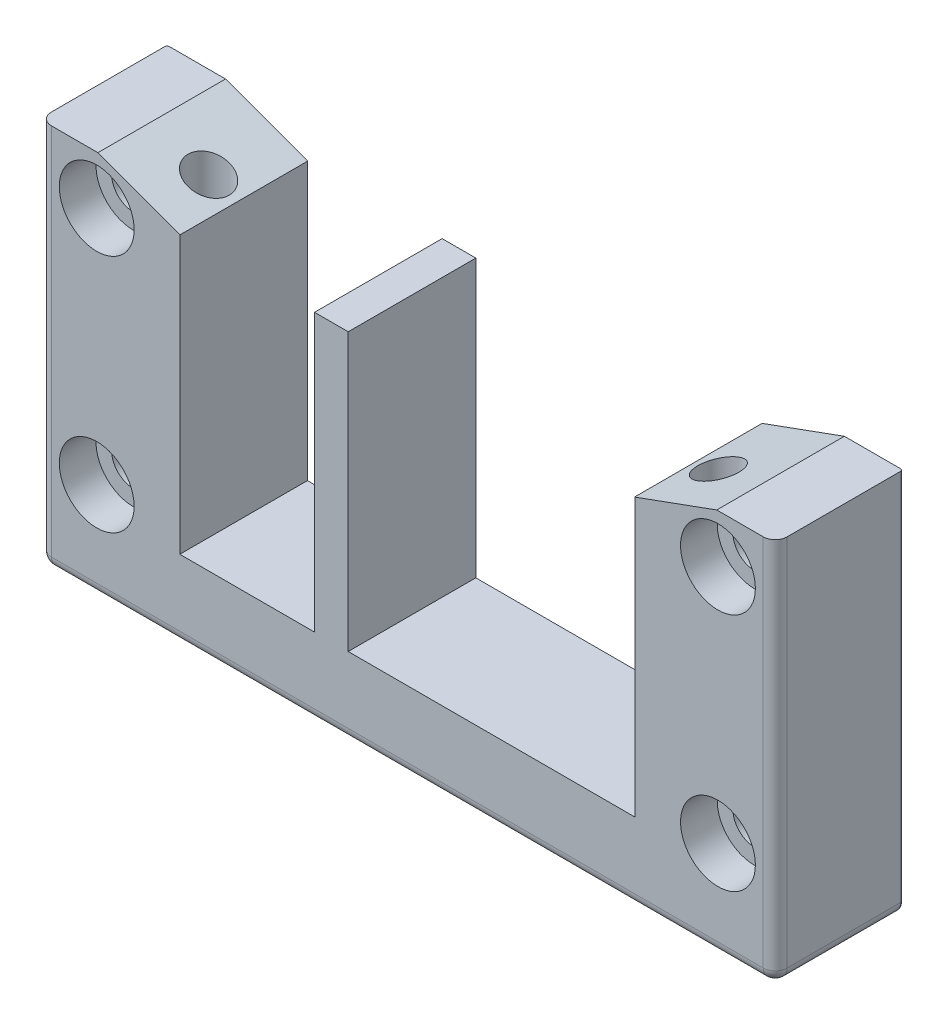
ISO-10303-21;
HEADER;
FILE_DESCRIPTION(('STEP AP214'),'2;1');
FILE_NAME('part.step','',(''),(''),'','','');
FILE_SCHEMA(('AUTOMOTIVE_DESIGN { 1 0 10303 214 1 1 1 1 }'));
ENDSEC;
DATA;
#1=APPLICATION_CONTEXT('core data for automotive mechanical design processes');
#2=APPLICATION_PROTOCOL_DEFINITION('international standard','automotive_design',2000,#1);
#3=PRODUCT_CONTEXT('',#1,'mechanical');
#4=PRODUCT('Part','Part','',(#3));
#5=PRODUCT_RELATED_PRODUCT_CATEGORY('part','',(#4));
#6=PRODUCT_DEFINITION_FORMATION('','',#4);
#7=PRODUCT_DEFINITION_CONTEXT('part definition',#1,'design');
#8=PRODUCT_DEFINITION('design','',#6,#7);
#9=PRODUCT_DEFINITION_SHAPE('','',#8);
#10=(LENGTH_UNIT() NAMED_UNIT(*) SI_UNIT(.MILLI.,.METRE.));
#11=(NAMED_UNIT(*) PLANE_ANGLE_UNIT() SI_UNIT($,.RADIAN.));
#12=(NAMED_UNIT(*) SI_UNIT($,.STERADIAN.) SOLID_ANGLE_UNIT());
#13=UNCERTAINTY_MEASURE_WITH_UNIT(LENGTH_MEASURE(1.E-05),#10,'distance_accuracy_value','');
#14=(GEOMETRIC_REPRESENTATION_CONTEXT(3) GLOBAL_UNCERTAINTY_ASSIGNED_CONTEXT((#13)) GLOBAL_UNIT_ASSIGNED_CONTEXT((#10,
#11,#12)) REPRESENTATION_CONTEXT('',''));
#15=CARTESIAN_POINT('',(0.,0.,0.));
#16=DIRECTION('',(0.,0.,1.));
#17=DIRECTION('',(1.,0.,0.));
#18=AXIS2_PLACEMENT_3D('',#15,#16,#17);
#19=CARTESIAN_POINT('',(-49.15,22.5,-17.05));
#20=DIRECTION('',(0.,1.,0.));
#21=DIRECTION('',(1.,0.,0.));
#22=AXIS2_PLACEMENT_3D('',#19,#20,#21);
#23=PLANE('',#22);
#24=DIRECTION('',(-1.,0.,0.));
#25=VECTOR('',#24,1.);
#26=CARTESIAN_POINT('',(-49.15,22.5,0.));
#27=LINE('',#26,#25);
#28=CARTESIAN_POINT('',(-41.34,22.5,0.));
#29=VERTEX_POINT('',#28);
#30=CARTESIAN_POINT('',(-47.55,22.5,0.));
#31=VERTEX_POINT('',#30);
#32=EDGE_CURVE('E648',#29,#31,#27,.T.);
#33=ORIENTED_EDGE('',*,*,#32,.F.);
#34=DIRECTION('',(0.,0.,1.));
#35=VECTOR('',#34,1.);
#36=CARTESIAN_POINT('',(-41.34,22.5,-17.05));
#37=LINE('',#36,#35);
#38=CARTESIAN_POINT('',(-41.34,22.5,-17.05));
#39=VERTEX_POINT('',#38);
#40=EDGE_CURVE('E10',#39,#29,#37,.T.);
#41=ORIENTED_EDGE('',*,*,#40,.F.);
#42=DIRECTION('',(-1.,0.,0.));
#43=VECTOR('',#42,1.);
#44=CARTESIAN_POINT('',(-49.15,22.5,-17.05));
#45=LINE('',#44,#43);
#46=CARTESIAN_POINT('',(-48.85,22.5,-17.05));
#47=VERTEX_POINT('',#46);
#48=EDGE_CURVE('E450',#39,#47,#45,.T.);
#49=ORIENTED_EDGE('',*,*,#48,.T.);
#50=CARTESIAN_POINT('',(-48.85,22.5,-16.75));
#51=DIRECTION('',(0.,-1.,0.));
#52=DIRECTION('',(0.,0.,1.));
#53=AXIS2_PLACEMENT_3D('',#50,#51,#52);
#54=CIRCLE('',#53,0.3);
#55=CARTESIAN_POINT('',(-49.15,22.5,-16.75));
#56=VERTEX_POINT('',#55);
#57=EDGE_CURVE('E439',#56,#47,#54,.T.);
#58=ORIENTED_EDGE('',*,*,#57,.F.);
#59=DIRECTION('',(0.,0.,1.));
#60=VECTOR('',#59,1.);
#61=CARTESIAN_POINT('',(-49.15,22.5,-17.05));
#62=LINE('',#61,#60);
#63=CARTESIAN_POINT('',(-49.15,22.5,-1.6));
#64=VERTEX_POINT('',#63);
#65=EDGE_CURVE('E460',#56,#64,#62,.T.);
#66=ORIENTED_EDGE('',*,*,#65,.T.);
#67=CARTESIAN_POINT('',(-47.55,22.5,-1.6));
#68=DIRECTION('',(0.,-1.,0.));
#69=DIRECTION('',(0.,0.,1.));
#70=AXIS2_PLACEMENT_3D('',#67,#68,#69);
#71=CIRCLE('',#70,1.6);
#72=EDGE_CURVE('E395',#31,#64,#71,.T.);
#73=ORIENTED_EDGE('',*,*,#72,.F.);
#74=EDGE_LOOP('',(#33,#41,#49,#58,#66,#73));
#75=FACE_BOUND('',#74,.T.);
#76=ADVANCED_FACE('F15',(#75),#23,.T.);
#77=CARTESIAN_POINT('',(-41.34,22.5,-17.05));
#78=DIRECTION('',(0.342020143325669,0.939692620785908,0.));
#79=DIRECTION('',(0.,0.,-1.));
#80=AXIS2_PLACEMENT_3D('',#77,#78,#79);
#81=PLANE('',#80);
#82=CARTESIAN_POINT('',(-36.8,20.8475751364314,-7.5));
#83=CARTESIAN_POINT('',(-36.8,20.8475751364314,-13.));
#84=CARTESIAN_POINT('',(-31.2999999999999,18.8457388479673,-13.));
#85=CARTESIAN_POINT('',(-31.3,18.8457388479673,-7.5));
#86=CARTESIAN_POINT('',(-31.2999999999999,18.8457388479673,-2.00000000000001));
#87=CARTESIAN_POINT('',(-36.8,20.8475751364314,-2.00000000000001));
#88=CARTESIAN_POINT('',(-36.8,20.8475751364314,-7.5));
#89=(BOUNDED_CURVE() B_SPLINE_CURVE(3,(#82,#83,#84,#85,#86,#87,#88),.UNSPECIFIED.,.T.,
.F.) B_SPLINE_CURVE_WITH_KNOTS((4,3,4),(0.,3.1415926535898,6.28318530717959),
.UNSPECIFIED.) CURVE() GEOMETRIC_REPRESENTATION_ITEM() RATIONAL_B_SPLINE_CURVE((1.,
0.333333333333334,0.333333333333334,1.,0.333333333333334,0.333333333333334,1.)) REPRESENTATION_ITEM(''));
#90=CARTESIAN_POINT('',(-36.8,20.8475751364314,-7.5));
#91=VERTEX_POINT('',#90);
#92=EDGE_CURVE('E197',#91,#91,#89,.T.);
#93=ORIENTED_EDGE('',*,*,#92,.T.);
#94=EDGE_LOOP('',(#93));
#95=FACE_BOUND('',#94,.T.);
#96=DIRECTION('',(-0.939692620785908,0.342020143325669,0.));
#97=VECTOR('',#96,1.);
#98=CARTESIAN_POINT('',(-41.34,22.5,0.));
#99=LINE('',#98,#97);
#100=CARTESIAN_POINT('',(-30.3500903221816,18.5,0.));
#101=VERTEX_POINT('',#100);
#102=EDGE_CURVE('E438',#101,#29,#99,.T.);
#103=ORIENTED_EDGE('',*,*,#102,.F.);
#104=DIRECTION('',(0.,0.,1.));
#105=VECTOR('',#104,1.);
#106=CARTESIAN_POINT('',(-30.3500903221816,18.5,-17.05));
#107=LINE('',#106,#105);
#108=CARTESIAN_POINT('',(-30.3500903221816,18.5,-17.05));
#109=VERTEX_POINT('',#108);
#110=EDGE_CURVE('E400',#109,#101,#107,.T.);
#111=ORIENTED_EDGE('',*,*,#110,.F.);
#112=DIRECTION('',(-0.939692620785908,0.342020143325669,0.));
#113=VECTOR('',#112,1.);
#114=CARTESIAN_POINT('',(-41.34,22.5,-17.05));
#115=LINE('',#114,#113);
#116=EDGE_CURVE('E453',#109,#39,#115,.T.);
#117=ORIENTED_EDGE('',*,*,#116,.T.);
#118=ORIENTED_EDGE('',*,*,#40,.T.);
#119=EDGE_LOOP('',(#103,#111,#117,#118));
#120=FACE_BOUND('',#119,.T.);
#121=ADVANCED_FACE('F759',(#95,#120),#81,.T.);
#122=CARTESIAN_POINT('',(41.34,22.5,-17.05));
#123=DIRECTION('',(-0.34202014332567,0.939692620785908,0.));
#124=DIRECTION('',(0.,0.,1.));
#125=AXIS2_PLACEMENT_3D('',#122,#123,#124);
#126=PLANE('',#125);
#127=CARTESIAN_POINT('',(36.8,20.8475751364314,-7.5));
#128=CARTESIAN_POINT('',(36.8,20.8475751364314,-2.00000000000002));
#129=CARTESIAN_POINT('',(31.3,18.8457388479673,-2.00000000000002));
#130=CARTESIAN_POINT('',(31.3,18.8457388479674,-7.5));
#131=CARTESIAN_POINT('',(31.3,18.8457388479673,-13.));
#132=CARTESIAN_POINT('',(36.8,20.8475751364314,-13.));
#133=CARTESIAN_POINT('',(36.8,20.8475751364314,-7.5));
#134=(BOUNDED_CURVE() B_SPLINE_CURVE(3,(#127,#128,#129,#130,#131,#132,#133),.UNSPECIFIED.,.T.,
.F.) B_SPLINE_CURVE_WITH_KNOTS((4,3,4),(0.,3.1415926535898,6.28318530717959),
.UNSPECIFIED.) CURVE() GEOMETRIC_REPRESENTATION_ITEM() RATIONAL_B_SPLINE_CURVE((1.,
0.333333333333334,0.333333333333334,1.,0.333333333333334,0.333333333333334,1.)) REPRESENTATION_ITEM(''));
#135=CARTESIAN_POINT('',(36.8,20.8475751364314,-7.5));
#136=VERTEX_POINT('',#135);
#137=EDGE_CURVE('E34',#136,#136,#134,.T.);
#138=ORIENTED_EDGE('',*,*,#137,.T.);
#139=EDGE_LOOP('',(#138));
#140=FACE_BOUND('',#139,.T.);
#141=DIRECTION('',(-0.939692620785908,-0.34202014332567,0.));
#142=VECTOR('',#141,1.);
#143=CARTESIAN_POINT('',(41.34,22.5,0.));
#144=LINE('',#143,#142);
#145=CARTESIAN_POINT('',(41.34,22.5,0.));
#146=VERTEX_POINT('',#145);
#147=CARTESIAN_POINT('',(30.3500903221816,18.5,0.));
#148=VERTEX_POINT('',#147);
#149=EDGE_CURVE('E425',#146,#148,#144,.T.);
#150=ORIENTED_EDGE('',*,*,#149,.F.);
#151=DIRECTION('',(0.,0.,1.));
#152=VECTOR('',#151,1.);
#153=CARTESIAN_POINT('',(41.34,22.5,-17.05));
#154=LINE('',#153,#152);
#155=CARTESIAN_POINT('',(41.34,22.5,-17.05));
#156=VERTEX_POINT('',#155);
#157=EDGE_CURVE('E24',#156,#146,#154,.T.);
#158=ORIENTED_EDGE('',*,*,#157,.F.);
#159=DIRECTION('',(-0.939692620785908,-0.34202014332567,0.));
#160=VECTOR('',#159,1.);
#161=CARTESIAN_POINT('',(41.34,22.5,-17.05));
#162=LINE('',#161,#160);
#163=CARTESIAN_POINT('',(30.3500903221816,18.5,-17.05));
#164=VERTEX_POINT('',#163);
#165=EDGE_CURVE('E393',#156,#164,#162,.T.);
#166=ORIENTED_EDGE('',*,*,#165,.T.);
#167=DIRECTION('',(0.,0.,1.));
#168=VECTOR('',#167,1.);
#169=CARTESIAN_POINT('',(30.3500903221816,18.5,-17.05));
#170=LINE('',#169,#168);
#171=EDGE_CURVE('E355',#164,#148,#170,.T.);
#172=ORIENTED_EDGE('',*,*,#171,.T.);
#173=EDGE_LOOP('',(#150,#158,#166,#172));
#174=FACE_BOUND('',#173,.T.);
#175=ADVANCED_FACE('F494',(#140,#174),#126,.T.);
#176=CARTESIAN_POINT('',(49.15,22.5,-17.05));
#177=DIRECTION('',(0.,1.,0.));
#178=DIRECTION('',(1.,0.,0.));
#179=AXIS2_PLACEMENT_3D('',#176,#177,#178);
#180=PLANE('',#179);
#181=DIRECTION('',(0.,0.,1.));
#182=VECTOR('',#181,1.);
#183=CARTESIAN_POINT('',(49.15,22.5,-17.05));
#184=LINE('',#183,#182);
#185=CARTESIAN_POINT('',(49.15,22.5,-16.75));
#186=VERTEX_POINT('',#185);
#187=CARTESIAN_POINT('',(49.15,22.5,-1.6));
#188=VERTEX_POINT('',#187);
#189=EDGE_CURVE('E358',#186,#188,#184,.T.);
#190=ORIENTED_EDGE('',*,*,#189,.F.);
#191=CARTESIAN_POINT('',(48.85,22.5,-16.75));
#192=DIRECTION('',(0.,-1.,0.));
#193=DIRECTION('',(-1.,0.,0.));
#194=AXIS2_PLACEMENT_3D('',#191,#192,#193);
#195=CIRCLE('',#194,0.3);
#196=CARTESIAN_POINT('',(48.85,22.5,-17.05));
#197=VERTEX_POINT('',#196);
#198=EDGE_CURVE('E278',#197,#186,#195,.T.);
#199=ORIENTED_EDGE('',*,*,#198,.F.);
#200=DIRECTION('',(-1.,0.,0.));
#201=VECTOR('',#200,1.);
#202=CARTESIAN_POINT('',(49.15,22.5,-17.05));
#203=LINE('',#202,#201);
#204=EDGE_CURVE('E277',#197,#156,#203,.T.);
#205=ORIENTED_EDGE('',*,*,#204,.T.);
#206=ORIENTED_EDGE('',*,*,#157,.T.);
#207=DIRECTION('',(-1.,0.,0.));
#208=VECTOR('',#207,1.);
#209=CARTESIAN_POINT('',(49.15,22.5,0.));
#210=LINE('',#209,#208);
#211=CARTESIAN_POINT('',(47.55,22.5,0.));
#212=VERTEX_POINT('',#211);
#213=EDGE_CURVE('E421',#212,#146,#210,.T.);
#214=ORIENTED_EDGE('',*,*,#213,.F.);
#215=CARTESIAN_POINT('',(47.55,22.5,-1.6));
#216=DIRECTION('',(0.,-1.,0.));
#217=DIRECTION('',(-1.,0.,0.));
#218=AXIS2_PLACEMENT_3D('',#215,#216,#217);
#219=CIRCLE('',#218,1.6);
#220=EDGE_CURVE('E508',#188,#212,#219,.T.);
#221=ORIENTED_EDGE('',*,*,#220,.F.);
#222=EDGE_LOOP('',(#190,#199,#205,#206,#214,#221));
#223=FACE_BOUND('',#222,.T.);
#224=ADVANCED_FACE('F487',(#223),#180,.T.);
#225=CARTESIAN_POINT('',(-30.3500903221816,18.5,-17.05));
#226=DIRECTION('',(0.,1.,0.));
#227=DIRECTION('',(1.,0.,0.));
#228=AXIS2_PLACEMENT_3D('',#225,#226,#227);
#229=PLANE('',#228);
#230=DIRECTION('',(-1.,0.,0.));
#231=VECTOR('',#230,1.);
#232=CARTESIAN_POINT('',(-30.3500903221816,18.5,-17.05));
#233=LINE('',#232,#231);
#234=CARTESIAN_POINT('',(-7.9,18.5,-17.05));
#235=VERTEX_POINT('',#234);
#236=CARTESIAN_POINT('',(-12.4,18.5,-17.05));
#237=VERTEX_POINT('',#236);
#238=EDGE_CURVE('E394',#235,#237,#233,.T.);
#239=ORIENTED_EDGE('',*,*,#238,.T.);
#240=DIRECTION('',(0.,0.,1.));
#241=VECTOR('',#240,1.);
#242=CARTESIAN_POINT('',(-12.4,18.5,-54.3226441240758));
#243=LINE('',#242,#241);
#244=CARTESIAN_POINT('',(-12.4,18.5,0.));
#245=VERTEX_POINT('',#244);
#246=EDGE_CURVE('E563',#237,#245,#243,.T.);
#247=ORIENTED_EDGE('',*,*,#246,.T.);
#248=DIRECTION('',(-1.,0.,0.));
#249=VECTOR('',#248,1.);
#250=CARTESIAN_POINT('',(-30.3500903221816,18.5,0.));
#251=LINE('',#250,#249);
#252=CARTESIAN_POINT('',(-7.9,18.5,0.));
#253=VERTEX_POINT('',#252);
#254=EDGE_CURVE('E434',#253,#245,#251,.T.);
#255=ORIENTED_EDGE('',*,*,#254,.F.);
#256=DIRECTION('',(0.,0.,1.));
#257=VECTOR('',#256,1.);
#258=CARTESIAN_POINT('',(-7.9,18.5,-54.3226441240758));
#259=LINE('',#258,#257);
#260=EDGE_CURVE('E411',#235,#253,#259,.T.);
#261=ORIENTED_EDGE('',*,*,#260,.F.);
#262=EDGE_LOOP('',(#239,#247,#255,#261));
#263=FACE_BOUND('',#262,.T.);
#264=ADVANCED_FACE('F946',(#263),#229,.T.);
#265=CARTESIAN_POINT('',(34.05,29.,-7.5));
#266=DIRECTION('',(0.,1.,0.));
#267=DIRECTION('',(0.,0.,1.));
#268=AXIS2_PLACEMENT_3D('',#265,#266,#267);
#269=CYLINDRICAL_SURFACE('',#268,2.75);
#270=CARTESIAN_POINT('',(34.05,-22.,-7.5));
#271=DIRECTION('',(0.,1.,0.));
#272=DIRECTION('',(0.,0.,-1.));
#273=AXIS2_PLACEMENT_3D('',#270,#271,#272);
#274=CIRCLE('',#273,2.75);
#275=CARTESIAN_POINT('',(34.05,-22.,-10.25));
#276=VERTEX_POINT('',#275);
#277=EDGE_CURVE('E472',#276,#276,#274,.T.);
#278=ORIENTED_EDGE('',*,*,#277,.F.);
#279=EDGE_LOOP('',(#278));
#280=FACE_BOUND('',#279,.T.);
#281=ORIENTED_EDGE('',*,*,#137,.F.);
#282=EDGE_LOOP('',(#281));
#283=FACE_BOUND('',#282,.T.);
#284=ADVANCED_FACE('F1089',(#280,#283),#269,.F.);
#285=CARTESIAN_POINT('',(0.,-22.,0.));
#286=DIRECTION('',(0.,-1.,0.));
#287=DIRECTION('',(0.,0.,-1.));
#288=AXIS2_PLACEMENT_3D('',#285,#286,#287);
#289=PLANE('',#288);
#290=ORIENTED_EDGE('',*,*,#277,.T.);
#291=EDGE_LOOP('',(#290));
#292=FACE_BOUND('',#291,.T.);
#293=DIRECTION('',(1.,0.,0.));
#294=VECTOR('',#293,1.);
#295=CARTESIAN_POINT('',(31.6828638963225,-22.,-11.6));
#296=LINE('',#295,#294);
#297=CARTESIAN_POINT('',(31.6828638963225,-22.,-11.6));
#298=VERTEX_POINT('',#297);
#299=CARTESIAN_POINT('',(36.4171361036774,-22.,-11.6));
#300=VERTEX_POINT('',#299);
#301=EDGE_CURVE('E465',#298,#300,#296,.T.);
#302=ORIENTED_EDGE('',*,*,#301,.T.);
#303=DIRECTION('',(0.5,0.,0.866025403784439));
#304=VECTOR('',#303,1.);
#305=CARTESIAN_POINT('',(36.4171361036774,-22.,-11.6));
#306=LINE('',#305,#304);
#307=CARTESIAN_POINT('',(38.7842722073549,-22.,-7.5));
#308=VERTEX_POINT('',#307);
#309=EDGE_CURVE('E581',#300,#308,#306,.T.);
#310=ORIENTED_EDGE('',*,*,#309,.T.);
#311=DIRECTION('',(-0.5,0.,0.866025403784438));
#312=VECTOR('',#311,1.);
#313=CARTESIAN_POINT('',(38.7842722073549,-22.,-7.5));
#314=LINE('',#313,#312);
#315=CARTESIAN_POINT('',(36.4171361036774,-22.,-3.4));
#316=VERTEX_POINT('',#315);
#317=EDGE_CURVE('E562',#308,#316,#314,.T.);
#318=ORIENTED_EDGE('',*,*,#317,.T.);
#319=DIRECTION('',(-1.,0.,0.));
#320=VECTOR('',#319,1.);
#321=CARTESIAN_POINT('',(36.4171361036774,-22.,-3.4));
#322=LINE('',#321,#320);
#323=CARTESIAN_POINT('',(31.6828638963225,-22.,-3.4));
#324=VERTEX_POINT('',#323);
#325=EDGE_CURVE('E547',#316,#324,#322,.T.);
#326=ORIENTED_EDGE('',*,*,#325,.T.);
#327=DIRECTION('',(-0.5,0.,-0.866025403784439));
#328=VECTOR('',#327,1.);
#329=CARTESIAN_POINT('',(31.6828638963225,-22.,-3.4));
#330=LINE('',#329,#328);
#331=CARTESIAN_POINT('',(29.3157277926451,-22.,-7.5));
#332=VERTEX_POINT('',#331);
#333=EDGE_CURVE('E531',#324,#332,#330,.T.);
#334=ORIENTED_EDGE('',*,*,#333,.T.);
#335=DIRECTION('',(0.5,0.,-0.866025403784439));
#336=VECTOR('',#335,1.);
#337=CARTESIAN_POINT('',(29.3157277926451,-22.,-7.5));
#338=LINE('',#337,#336);
#339=EDGE_CURVE('E790',#332,#298,#338,.T.);
#340=ORIENTED_EDGE('',*,*,#339,.T.);
#341=EDGE_LOOP('',(#302,#310,#318,#326,#334,#340));
#342=FACE_BOUND('',#341,.T.);
#343=ADVANCED_FACE('F1003',(#292,#342),#289,.T.);
#344=CARTESIAN_POINT('',(31.6828638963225,-22.,-11.6));
#345=DIRECTION('',(0.,0.,-1.));
#346=DIRECTION('',(0.,-1.,0.));
#347=AXIS2_PLACEMENT_3D('',#344,#345,#346);
#348=PLANE('',#347);
#349=DIRECTION('',(1.,0.,0.));
#350=VECTOR('',#349,1.);
#351=CARTESIAN_POINT('',(31.6828638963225,-29.,-11.6));
#352=LINE('',#351,#350);
#353=CARTESIAN_POINT('',(31.6828638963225,-29.,-11.6));
#354=VERTEX_POINT('',#353);
#355=CARTESIAN_POINT('',(36.4171361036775,-29.,-11.6));
#356=VERTEX_POINT('',#355);
#357=EDGE_CURVE('E525',#354,#356,#352,.T.);
#358=ORIENTED_EDGE('',*,*,#357,.T.);
#359=DIRECTION('',(0.,-1.,0.));
#360=VECTOR('',#359,1.);
#361=CARTESIAN_POINT('',(36.4171361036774,-22.,-11.6));
#362=LINE('',#361,#360);
#363=EDGE_CURVE('E576',#300,#356,#362,.T.);
#364=ORIENTED_EDGE('',*,*,#363,.F.);
#365=ORIENTED_EDGE('',*,*,#301,.F.);
#366=DIRECTION('',(0.,-1.,0.));
#367=VECTOR('',#366,1.);
#368=CARTESIAN_POINT('',(31.6828638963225,-22.,-11.6));
#369=LINE('',#368,#367);
#370=EDGE_CURVE('E786',#298,#354,#369,.T.);
#371=ORIENTED_EDGE('',*,*,#370,.T.);
#372=EDGE_LOOP('',(#358,#364,#365,#371));
#373=FACE_BOUND('',#372,.T.);
#374=ADVANCED_FACE('F1027',(#373),#348,.F.);
#375=CARTESIAN_POINT('',(-34.05,29.,-7.5));
#376=DIRECTION('',(0.,1.,0.));
#377=DIRECTION('',(0.,0.,1.));
#378=AXIS2_PLACEMENT_3D('',#375,#376,#377);
#379=CYLINDRICAL_SURFACE('',#378,2.75);
#380=CARTESIAN_POINT('',(-34.05,-22.,-7.5));
#381=DIRECTION('',(0.,1.,0.));
#382=DIRECTION('',(0.,0.,-1.));
#383=AXIS2_PLACEMENT_3D('',#380,#381,#382);
#384=CIRCLE('',#383,2.75);
#385=CARTESIAN_POINT('',(-34.05,-22.,-10.25));
#386=VERTEX_POINT('',#385);
#387=EDGE_CURVE('E206',#386,#386,#384,.T.);
#388=ORIENTED_EDGE('',*,*,#387,.F.);
#389=EDGE_LOOP('',(#388));
#390=FACE_BOUND('',#389,.T.);
#391=ORIENTED_EDGE('',*,*,#92,.F.);
#392=EDGE_LOOP('',(#391));
#393=FACE_BOUND('',#392,.T.);
#394=ADVANCED_FACE('F1081',(#390,#393),#379,.F.);
#395=CARTESIAN_POINT('',(0.,-22.,0.));
#396=DIRECTION('',(0.,-1.,0.));
#397=DIRECTION('',(0.,0.,-1.));
#398=AXIS2_PLACEMENT_3D('',#395,#396,#397);
#399=PLANE('',#398);
#400=ORIENTED_EDGE('',*,*,#387,.T.);
#401=EDGE_LOOP('',(#400));
#402=FACE_BOUND('',#401,.T.);
#403=DIRECTION('',(1.,0.,0.));
#404=VECTOR('',#403,1.);
#405=CARTESIAN_POINT('',(-36.4171361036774,-22.,-11.6));
#406=LINE('',#405,#404);
#407=CARTESIAN_POINT('',(-36.4171361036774,-22.,-11.6));
#408=VERTEX_POINT('',#407);
#409=CARTESIAN_POINT('',(-31.6828638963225,-22.,-11.6));
#410=VERTEX_POINT('',#409);
#411=EDGE_CURVE('E339',#408,#410,#406,.T.);
#412=ORIENTED_EDGE('',*,*,#411,.T.);
#413=DIRECTION('',(0.5,0.,0.866025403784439));
#414=VECTOR('',#413,1.);
#415=CARTESIAN_POINT('',(-31.6828638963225,-22.,-11.6));
#416=LINE('',#415,#414);
#417=CARTESIAN_POINT('',(-29.315727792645,-22.,-7.5));
#418=VERTEX_POINT('',#417);
#419=EDGE_CURVE('E667',#410,#418,#416,.T.);
#420=ORIENTED_EDGE('',*,*,#419,.T.);
#421=DIRECTION('',(-0.5,0.,0.866025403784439));
#422=VECTOR('',#421,1.);
#423=CARTESIAN_POINT('',(-29.315727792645,-22.,-7.5));
#424=LINE('',#423,#422);
#425=CARTESIAN_POINT('',(-31.6828638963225,-22.,-3.4));
#426=VERTEX_POINT('',#425);
#427=EDGE_CURVE('E652',#418,#426,#424,.T.);
#428=ORIENTED_EDGE('',*,*,#427,.T.);
#429=DIRECTION('',(-1.,0.,0.));
#430=VECTOR('',#429,1.);
#431=CARTESIAN_POINT('',(-31.6828638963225,-22.,-3.4));
#432=LINE('',#431,#430);
#433=CARTESIAN_POINT('',(-36.4171361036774,-22.,-3.4));
#434=VERTEX_POINT('',#433);
#435=EDGE_CURVE('E633',#426,#434,#432,.T.);
#436=ORIENTED_EDGE('',*,*,#435,.T.);
#437=DIRECTION('',(-0.5,0.,-0.866025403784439));
#438=VECTOR('',#437,1.);
#439=CARTESIAN_POINT('',(-36.4171361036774,-22.,-3.4));
#440=LINE('',#439,#438);
#441=CARTESIAN_POINT('',(-38.7842722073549,-22.,-7.5));
#442=VERTEX_POINT('',#441);
#443=EDGE_CURVE('E618',#434,#442,#440,.T.);
#444=ORIENTED_EDGE('',*,*,#443,.T.);
#445=DIRECTION('',(0.5,0.,-0.866025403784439));
#446=VECTOR('',#445,1.);
#447=CARTESIAN_POINT('',(-38.7842722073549,-22.,-7.5));
#448=LINE('',#447,#446);
#449=EDGE_CURVE('E598',#442,#408,#448,.T.);
#450=ORIENTED_EDGE('',*,*,#449,.T.);
#451=EDGE_LOOP('',(#412,#420,#428,#436,#444,#450));
#452=FACE_BOUND('',#451,.T.);
#453=ADVANCED_FACE('F1079',(#402,#452),#399,.T.);
#454=CARTESIAN_POINT('',(-36.4171361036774,-22.,-11.6));
#455=DIRECTION('',(0.,0.,-1.));
#456=DIRECTION('',(-1.,0.,0.));
#457=AXIS2_PLACEMENT_3D('',#454,#455,#456);
#458=PLANE('',#457);
#459=DIRECTION('',(1.,0.,0.));
#460=VECTOR('',#459,1.);
#461=CARTESIAN_POINT('',(-36.4171361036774,-29.,-11.6));
#462=LINE('',#461,#460);
#463=CARTESIAN_POINT('',(-36.4171361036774,-29.,-11.6));
#464=VERTEX_POINT('',#463);
#465=CARTESIAN_POINT('',(-31.6828638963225,-29.,-11.6));
#466=VERTEX_POINT('',#465);
#467=EDGE_CURVE('E529',#464,#466,#462,.T.);
#468=ORIENTED_EDGE('',*,*,#467,.T.);
#469=DIRECTION('',(0.,-1.,0.));
#470=VECTOR('',#469,1.);
#471=CARTESIAN_POINT('',(-31.6828638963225,-22.,-11.6));
#472=LINE('',#471,#470);
#473=EDGE_CURVE('E674',#410,#466,#472,.T.);
#474=ORIENTED_EDGE('',*,*,#473,.F.);
#475=ORIENTED_EDGE('',*,*,#411,.F.);
#476=DIRECTION('',(0.,-1.,0.));
#477=VECTOR('',#476,1.);
#478=CARTESIAN_POINT('',(-36.4171361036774,-22.,-11.6));
#479=LINE('',#478,#477);
#480=EDGE_CURVE('E590',#408,#464,#479,.T.);
#481=ORIENTED_EDGE('',*,*,#480,.T.);
#482=EDGE_LOOP('',(#468,#474,#475,#481));
#483=FACE_BOUND('',#482,.T.);
#484=ADVANCED_FACE('F1076',(#483),#458,.F.);
#485=CARTESIAN_POINT('',(-30.4,18.5,-17.05));
#486=DIRECTION('',(0.,1.,0.));
#487=DIRECTION('',(1.,0.,0.));
#488=AXIS2_PLACEMENT_3D('',#485,#486,#487);
#489=PLANE('',#488);
#490=ORIENTED_EDGE('',*,*,#171,.F.);
#491=DIRECTION('',(-1.,0.,0.));
#492=VECTOR('',#491,1.);
#493=CARTESIAN_POINT('',(-30.4,18.5,-17.05));
#494=LINE('',#493,#492);
#495=CARTESIAN_POINT('',(30.4,18.5,-17.05));
#496=VERTEX_POINT('',#495);
#497=EDGE_CURVE('E389',#496,#164,#494,.T.);
#498=ORIENTED_EDGE('',*,*,#497,.F.);
#499=DIRECTION('',(0.,0.,1.));
#500=VECTOR('',#499,1.);
#501=CARTESIAN_POINT('',(30.4,18.5,-17.05));
#502=LINE('',#501,#500);
#503=CARTESIAN_POINT('',(30.4,18.5,0.));
#504=VERTEX_POINT('',#503);
#505=EDGE_CURVE('E335',#496,#504,#502,.T.);
#506=ORIENTED_EDGE('',*,*,#505,.T.);
#507=DIRECTION('',(-1.,0.,0.));
#508=VECTOR('',#507,1.);
#509=CARTESIAN_POINT('',(-30.4,18.5,0.));
#510=LINE('',#509,#508);
#511=EDGE_CURVE('E430',#504,#148,#510,.T.);
#512=ORIENTED_EDGE('',*,*,#511,.T.);
#513=EDGE_LOOP('',(#490,#498,#506,#512));
#514=FACE_BOUND('',#513,.T.);
#515=ADVANCED_FACE('F965',(#514),#489,.F.);
#516=CARTESIAN_POINT('',(49.15,29.,-17.05));
#517=DIRECTION('',(1.,0.,0.));
#518=DIRECTION('',(0.,1.,0.));
#519=AXIS2_PLACEMENT_3D('',#516,#517,#518);
#520=PLANE('',#519);
#521=DIRECTION('',(0.,1.,0.));
#522=VECTOR('',#521,1.);
#523=CARTESIAN_POINT('',(49.15,27.4,-16.75));
#524=LINE('',#523,#522);
#525=CARTESIAN_POINT('',(49.15,-27.4,-16.75));
#526=VERTEX_POINT('',#525);
#527=EDGE_CURVE('E273',#526,#186,#524,.T.);
#528=ORIENTED_EDGE('',*,*,#527,.T.);
#529=ORIENTED_EDGE('',*,*,#189,.T.);
#530=DIRECTION('',(0.,-1.,0.));
#531=VECTOR('',#530,1.);
#532=CARTESIAN_POINT('',(49.15,29.,-1.6));
#533=LINE('',#532,#531);
#534=CARTESIAN_POINT('',(49.15,-27.4,-1.6));
#535=VERTEX_POINT('',#534);
#536=EDGE_CURVE('E420',#188,#535,#533,.T.);
#537=ORIENTED_EDGE('',*,*,#536,.T.);
#538=DIRECTION('',(0.,0.,-1.));
#539=VECTOR('',#538,1.);
#540=CARTESIAN_POINT('',(49.15,-27.4,-17.05));
#541=LINE('',#540,#539);
#542=EDGE_CURVE('E259',#535,#526,#541,.T.);
#543=ORIENTED_EDGE('',*,*,#542,.T.);
#544=EDGE_LOOP('',(#528,#529,#537,#543));
#545=FACE_BOUND('',#544,.T.);
#546=ADVANCED_FACE('F1072',(#545),#520,.T.);
#547=CARTESIAN_POINT('',(-49.15,29.,-17.05));
#548=DIRECTION('',(-1.,0.,0.));
#549=DIRECTION('',(0.,1.,0.));
#550=AXIS2_PLACEMENT_3D('',#547,#548,#549);
#551=PLANE('',#550);
#552=DIRECTION('',(0.,1.,0.));
#553=VECTOR('',#552,1.);
#554=CARTESIAN_POINT('',(-49.15,29.,-1.6));
#555=LINE('',#554,#553);
#556=CARTESIAN_POINT('',(-49.15,-27.4,-1.6));
#557=VERTEX_POINT('',#556);
#558=EDGE_CURVE('E399',#557,#64,#555,.T.);
#559=ORIENTED_EDGE('',*,*,#558,.T.);
#560=ORIENTED_EDGE('',*,*,#65,.F.);
#561=DIRECTION('',(0.,-1.,0.));
#562=VECTOR('',#561,1.);
#563=CARTESIAN_POINT('',(-49.15,-27.4,-16.75));
#564=LINE('',#563,#562);
#565=CARTESIAN_POINT('',(-49.15,-27.4,-16.75));
#566=VERTEX_POINT('',#565);
#567=EDGE_CURVE('E443',#56,#566,#564,.T.);
#568=ORIENTED_EDGE('',*,*,#567,.T.);
#569=DIRECTION('',(0.,0.,1.));
#570=VECTOR('',#569,1.);
#571=CARTESIAN_POINT('',(-49.15,-27.4,-17.05));
#572=LINE('',#571,#570);
#573=EDGE_CURVE('E272',#566,#557,#572,.T.);
#574=ORIENTED_EDGE('',*,*,#573,.T.);
#575=EDGE_LOOP('',(#559,#560,#568,#574));
#576=FACE_BOUND('',#575,.T.);
#577=ADVANCED_FACE('F988',(#576),#551,.T.);
#578=CARTESIAN_POINT('',(0.,0.,-17.05));
#579=DIRECTION('',(0.,0.,1.));
#580=DIRECTION('',(1.,0.,0.));
#581=AXIS2_PLACEMENT_3D('',#578,#579,#580);
#582=PLANE('',#581);
#583=CARTESIAN_POINT('',(-41.5,16.,-17.05));
#584=DIRECTION('',(0.,0.,1.));
#585=DIRECTION('',(1.,0.,0.));
#586=AXIS2_PLACEMENT_3D('',#583,#584,#585);
#587=CIRCLE('',#586,2.9);
#588=CARTESIAN_POINT('',(-38.6,16.,-17.05));
#589=VERTEX_POINT('',#588);
#590=EDGE_CURVE('E315',#589,#589,#587,.T.);
#591=ORIENTED_EDGE('',*,*,#590,.T.);
#592=EDGE_LOOP('',(#591));
#593=FACE_BOUND('',#592,.T.);
#594=CARTESIAN_POINT('',(-41.5,-16.,-17.05));
#595=DIRECTION('',(0.,0.,1.));
#596=DIRECTION('',(1.,0.,0.));
#597=AXIS2_PLACEMENT_3D('',#594,#595,#596);
#598=CIRCLE('',#597,2.9);
#599=CARTESIAN_POINT('',(-38.6,-16.,-17.05));
#600=VERTEX_POINT('',#599);
#601=EDGE_CURVE('E319',#600,#600,#598,.T.);
#602=ORIENTED_EDGE('',*,*,#601,.T.);
#603=EDGE_LOOP('',(#602));
#604=FACE_BOUND('',#603,.T.);
#605=CARTESIAN_POINT('',(41.5,-16.,-17.05));
#606=DIRECTION('',(0.,0.,1.));
#607=DIRECTION('',(1.,0.,0.));
#608=AXIS2_PLACEMENT_3D('',#605,#606,#607);
#609=CIRCLE('',#608,2.9);
#610=CARTESIAN_POINT('',(44.4,-16.,-17.05));
#611=VERTEX_POINT('',#610);
#612=EDGE_CURVE('E330',#611,#611,#609,.T.);
#613=ORIENTED_EDGE('',*,*,#612,.T.);
#614=EDGE_LOOP('',(#613));
#615=FACE_BOUND('',#614,.T.);
#616=CARTESIAN_POINT('',(41.5,16.,-17.05));
#617=DIRECTION('',(0.,0.,1.));
#618=DIRECTION('',(1.,0.,0.));
#619=AXIS2_PLACEMENT_3D('',#616,#617,#618);
#620=CIRCLE('',#619,2.9);
#621=CARTESIAN_POINT('',(44.4,16.,-17.05));
#622=VERTEX_POINT('',#621);
#623=EDGE_CURVE('E326',#622,#622,#620,.T.);
#624=ORIENTED_EDGE('',*,*,#623,.T.);
#625=EDGE_LOOP('',(#624));
#626=FACE_BOUND('',#625,.T.);
#627=ORIENTED_EDGE('',*,*,#204,.F.);
#628=DIRECTION('',(0.,-1.,0.));
#629=VECTOR('',#628,1.);
#630=CARTESIAN_POINT('',(48.85,-27.4,-17.05));
#631=LINE('',#630,#629);
#632=CARTESIAN_POINT('',(48.85,-27.4,-17.05));
#633=VERTEX_POINT('',#632);
#634=EDGE_CURVE('E294',#197,#633,#631,.T.);
#635=ORIENTED_EDGE('',*,*,#634,.T.);
#636=CARTESIAN_POINT('',(47.55,-27.4,-17.05));
#637=DIRECTION('',(0.,0.,-1.));
#638=DIRECTION('',(1.,0.,0.));
#639=AXIS2_PLACEMENT_3D('',#636,#637,#638);
#640=CIRCLE('',#639,1.3);
#641=CARTESIAN_POINT('',(47.55,-28.7,-17.05));
#642=VERTEX_POINT('',#641);
#643=EDGE_CURVE('E310',#633,#642,#640,.T.);
#644=ORIENTED_EDGE('',*,*,#643,.T.);
#645=DIRECTION('',(-1.,0.,0.));
#646=VECTOR('',#645,1.);
#647=CARTESIAN_POINT('',(-47.55,-28.7,-17.05));
#648=LINE('',#647,#646);
#649=CARTESIAN_POINT('',(-47.55,-28.7,-17.05));
#650=VERTEX_POINT('',#649);
#651=EDGE_CURVE('E306',#642,#650,#648,.T.);
#652=ORIENTED_EDGE('',*,*,#651,.T.);
#653=CARTESIAN_POINT('',(-47.55,-27.4,-17.05));
#654=DIRECTION('',(0.,0.,-1.));
#655=DIRECTION('',(1.,0.,0.));
#656=AXIS2_PLACEMENT_3D('',#653,#654,#655);
#657=CIRCLE('',#656,1.3);
#658=CARTESIAN_POINT('',(-48.85,-27.4,-17.05));
#659=VERTEX_POINT('',#658);
#660=EDGE_CURVE('E302',#650,#659,#657,.T.);
#661=ORIENTED_EDGE('',*,*,#660,.T.);
#662=DIRECTION('',(0.,1.,0.));
#663=VECTOR('',#662,1.);
#664=CARTESIAN_POINT('',(-48.85,27.4,-17.05));
#665=LINE('',#664,#663);
#666=EDGE_CURVE('E298',#659,#47,#665,.T.);
#667=ORIENTED_EDGE('',*,*,#666,.T.);
#668=ORIENTED_EDGE('',*,*,#48,.F.);
#669=ORIENTED_EDGE('',*,*,#116,.F.);
#670=DIRECTION('',(-1.,0.,0.));
#671=VECTOR('',#670,1.);
#672=CARTESIAN_POINT('',(-30.4,18.5,-17.05));
#673=LINE('',#672,#671);
#674=CARTESIAN_POINT('',(-30.4,18.5,-17.05));
#675=VERTEX_POINT('',#674);
#676=EDGE_CURVE('E407',#109,#675,#673,.T.);
#677=ORIENTED_EDGE('',*,*,#676,.T.);
#678=DIRECTION('',(0.,-1.,0.));
#679=VECTOR('',#678,1.);
#680=CARTESIAN_POINT('',(-30.4,18.5,-17.05));
#681=LINE('',#680,#679);
#682=CARTESIAN_POINT('',(-30.4,-18.5,-17.05));
#683=VERTEX_POINT('',#682);
#684=EDGE_CURVE('E366',#675,#683,#681,.T.);
#685=ORIENTED_EDGE('',*,*,#684,.T.);
#686=DIRECTION('',(1.,0.,0.));
#687=VECTOR('',#686,1.);
#688=CARTESIAN_POINT('',(-30.4,-18.5,-17.05));
#689=LINE('',#688,#687);
#690=CARTESIAN_POINT('',(-12.4,-18.5,-17.05));
#691=VERTEX_POINT('',#690);
#692=EDGE_CURVE('E324',#683,#691,#689,.T.);
#693=ORIENTED_EDGE('',*,*,#692,.T.);
#694=DIRECTION('',(0.,1.,0.));
#695=VECTOR('',#694,1.);
#696=CARTESIAN_POINT('',(-12.4,18.5,-17.05));
#697=LINE('',#696,#695);
#698=EDGE_CURVE('E410',#691,#237,#697,.T.);
#699=ORIENTED_EDGE('',*,*,#698,.T.);
#700=ORIENTED_EDGE('',*,*,#238,.F.);
#701=DIRECTION('',(0.,-1.,0.));
#702=VECTOR('',#701,1.);
#703=CARTESIAN_POINT('',(-7.9,18.5,-17.05));
#704=LINE('',#703,#702);
#705=CARTESIAN_POINT('',(-7.9,-18.5,-17.05));
#706=VERTEX_POINT('',#705);
#707=EDGE_CURVE('E416',#235,#706,#704,.T.);
#708=ORIENTED_EDGE('',*,*,#707,.T.);
#709=DIRECTION('',(1.,0.,0.));
#710=VECTOR('',#709,1.);
#711=CARTESIAN_POINT('',(-30.4,-18.5,-17.05));
#712=LINE('',#711,#710);
#713=CARTESIAN_POINT('',(30.4,-18.5,-17.05));
#714=VERTEX_POINT('',#713);
#715=EDGE_CURVE('E380',#706,#714,#712,.T.);
#716=ORIENTED_EDGE('',*,*,#715,.T.);
#717=DIRECTION('',(0.,1.,0.));
#718=VECTOR('',#717,1.);
#719=CARTESIAN_POINT('',(30.4,18.5,-17.05));
#720=LINE('',#719,#718);
#721=EDGE_CURVE('E343',#714,#496,#720,.T.);
#722=ORIENTED_EDGE('',*,*,#721,.T.);
#723=ORIENTED_EDGE('',*,*,#497,.T.);
#724=ORIENTED_EDGE('',*,*,#165,.F.);
#725=EDGE_LOOP('',(#627,#635,#644,#652,#661,#667,#668,#669,#677,#685,#693,#699,#700,#708,#716,
#722,#723,#724));
#726=FACE_BOUND('',#725,.T.);
#727=ADVANCED_FACE('F816',(#593,#604,#615,#626,#726),#582,.F.);
#728=CARTESIAN_POINT('',(48.85,29.,-16.75));
#729=DIRECTION('',(0.,-1.,0.));
#730=DIRECTION('',(1.,0.,0.));
#731=AXIS2_PLACEMENT_3D('',#728,#729,#730);
#732=CYLINDRICAL_SURFACE('',#731,0.3);
#733=ORIENTED_EDGE('',*,*,#634,.F.);
#734=ORIENTED_EDGE('',*,*,#198,.T.);
#735=ORIENTED_EDGE('',*,*,#527,.F.);
#736=CARTESIAN_POINT('',(48.85,-27.4,-16.75));
#737=DIRECTION('',(0.,1.,0.));
#738=DIRECTION('',(0.,0.,1.));
#739=AXIS2_PLACEMENT_3D('',#736,#737,#738);
#740=CIRCLE('',#739,0.3);
#741=EDGE_CURVE('E376',#526,#633,#740,.T.);
#742=ORIENTED_EDGE('',*,*,#741,.T.);
#743=EDGE_LOOP('',(#733,#734,#735,#742));
#744=FACE_BOUND('',#743,.T.);
#745=ADVANCED_FACE('F968',(#744),#732,.T.);
#746=CARTESIAN_POINT('',(-48.85,29.,-16.75));
#747=DIRECTION('',(0.,1.,0.));
#748=DIRECTION('',(-1.,0.,0.));
#749=AXIS2_PLACEMENT_3D('',#746,#747,#748);
#750=CYLINDRICAL_SURFACE('',#749,0.3);
#751=ORIENTED_EDGE('',*,*,#567,.F.);
#752=ORIENTED_EDGE('',*,*,#57,.T.);
#753=ORIENTED_EDGE('',*,*,#666,.F.);
#754=CARTESIAN_POINT('',(-48.85,-27.4,-16.75));
#755=DIRECTION('',(0.,1.,0.));
#756=DIRECTION('',(0.,0.,1.));
#757=AXIS2_PLACEMENT_3D('',#754,#755,#756);
#758=CIRCLE('',#757,0.3);
#759=EDGE_CURVE('E288',#659,#566,#758,.T.);
#760=ORIENTED_EDGE('',*,*,#759,.T.);
#761=EDGE_LOOP('',(#751,#752,#753,#760));
#762=FACE_BOUND('',#761,.T.);
#763=ADVANCED_FACE('F742',(#762),#750,.T.);
#764=CARTESIAN_POINT('',(0.,0.,0.));
#765=DIRECTION('',(0.,0.,1.));
#766=DIRECTION('',(1.,0.,0.));
#767=AXIS2_PLACEMENT_3D('',#764,#765,#766);
#768=PLANE('',#767);
#769=CARTESIAN_POINT('',(41.5,16.,0.));
#770=DIRECTION('',(0.,0.,1.));
#771=DIRECTION('',(1.,0.,0.));
#772=AXIS2_PLACEMENT_3D('',#769,#770,#771);
#773=CIRCLE('',#772,5.);
#774=CARTESIAN_POINT('',(46.5,16.,0.));
#775=VERTEX_POINT('',#774);
#776=EDGE_CURVE('E344',#775,#775,#773,.T.);
#777=ORIENTED_EDGE('',*,*,#776,.F.);
#778=EDGE_LOOP('',(#777));
#779=FACE_BOUND('',#778,.T.);
#780=CARTESIAN_POINT('',(41.5,-16.,0.));
#781=DIRECTION('',(0.,0.,1.));
#782=DIRECTION('',(1.,0.,0.));
#783=AXIS2_PLACEMENT_3D('',#780,#781,#782);
#784=CIRCLE('',#783,5.);
#785=CARTESIAN_POINT('',(46.5,-16.,0.));
#786=VERTEX_POINT('',#785);
#787=EDGE_CURVE('E347',#786,#786,#784,.T.);
#788=ORIENTED_EDGE('',*,*,#787,.F.);
#789=EDGE_LOOP('',(#788));
#790=FACE_BOUND('',#789,.T.);
#791=CARTESIAN_POINT('',(-41.5,-16.,0.));
#792=DIRECTION('',(0.,0.,1.));
#793=DIRECTION('',(1.,0.,0.));
#794=AXIS2_PLACEMENT_3D('',#791,#792,#793);
#795=CIRCLE('',#794,5.);
#796=CARTESIAN_POINT('',(-36.5,-16.,0.));
#797=VERTEX_POINT('',#796);
#798=EDGE_CURVE('E351',#797,#797,#795,.T.);
#799=ORIENTED_EDGE('',*,*,#798,.F.);
#800=EDGE_LOOP('',(#799));
#801=FACE_BOUND('',#800,.T.);
#802=CARTESIAN_POINT('',(-41.5,16.,0.));
#803=DIRECTION('',(0.,0.,1.));
#804=DIRECTION('',(1.,0.,0.));
#805=AXIS2_PLACEMENT_3D('',#802,#803,#804);
#806=CIRCLE('',#805,5.);
#807=CARTESIAN_POINT('',(-36.5,16.,0.));
#808=VERTEX_POINT('',#807);
#809=EDGE_CURVE('E354',#808,#808,#806,.T.);
#810=ORIENTED_EDGE('',*,*,#809,.F.);
#811=EDGE_LOOP('',(#810));
#812=FACE_BOUND('',#811,.T.);
#813=DIRECTION('',(0.,1.,0.));
#814=VECTOR('',#813,1.);
#815=CARTESIAN_POINT('',(47.55,0.,0.));
#816=LINE('',#815,#814);
#817=CARTESIAN_POINT('',(47.55,-27.4,0.));
#818=VERTEX_POINT('',#817);
#819=EDGE_CURVE('E426',#818,#212,#816,.T.);
#820=ORIENTED_EDGE('',*,*,#819,.T.);
#821=ORIENTED_EDGE('',*,*,#213,.T.);
#822=ORIENTED_EDGE('',*,*,#149,.T.);
#823=ORIENTED_EDGE('',*,*,#511,.F.);
#824=DIRECTION('',(0.,1.,0.));
#825=VECTOR('',#824,1.);
#826=CARTESIAN_POINT('',(30.4,18.5,0.));
#827=LINE('',#826,#825);
#828=CARTESIAN_POINT('',(30.4,-18.5,0.));
#829=VERTEX_POINT('',#828);
#830=EDGE_CURVE('E331',#829,#504,#827,.T.);
#831=ORIENTED_EDGE('',*,*,#830,.F.);
#832=DIRECTION('',(1.,0.,0.));
#833=VECTOR('',#832,1.);
#834=CARTESIAN_POINT('',(-30.4,-18.5,0.));
#835=LINE('',#834,#833);
#836=CARTESIAN_POINT('',(-7.9,-18.5,0.));
#837=VERTEX_POINT('',#836);
#838=EDGE_CURVE('E384',#837,#829,#835,.T.);
#839=ORIENTED_EDGE('',*,*,#838,.F.);
#840=DIRECTION('',(0.,1.,0.));
#841=VECTOR('',#840,1.);
#842=CARTESIAN_POINT('',(-7.9,18.5,0.));
#843=LINE('',#842,#841);
#844=EDGE_CURVE('E415',#837,#253,#843,.T.);
#845=ORIENTED_EDGE('',*,*,#844,.T.);
#846=ORIENTED_EDGE('',*,*,#254,.T.);
#847=DIRECTION('',(0.,-1.,0.));
#848=VECTOR('',#847,1.);
#849=CARTESIAN_POINT('',(-12.4,18.5,0.));
#850=LINE('',#849,#848);
#851=CARTESIAN_POINT('',(-12.4,-18.5,0.));
#852=VERTEX_POINT('',#851);
#853=EDGE_CURVE('E567',#245,#852,#850,.T.);
#854=ORIENTED_EDGE('',*,*,#853,.T.);
#855=DIRECTION('',(1.,0.,0.));
#856=VECTOR('',#855,1.);
#857=CARTESIAN_POINT('',(-30.4,-18.5,0.));
#858=LINE('',#857,#856);
#859=CARTESIAN_POINT('',(-30.4,-18.5,0.));
#860=VERTEX_POINT('',#859);
#861=EDGE_CURVE('E325',#860,#852,#858,.T.);
#862=ORIENTED_EDGE('',*,*,#861,.F.);
#863=DIRECTION('',(0.,-1.,0.));
#864=VECTOR('',#863,1.);
#865=CARTESIAN_POINT('',(-30.4,18.5,0.));
#866=LINE('',#865,#864);
#867=CARTESIAN_POINT('',(-30.4,18.5,0.));
#868=VERTEX_POINT('',#867);
#869=EDGE_CURVE('E361',#868,#860,#866,.T.);
#870=ORIENTED_EDGE('',*,*,#869,.F.);
#871=DIRECTION('',(-1.,0.,0.));
#872=VECTOR('',#871,1.);
#873=CARTESIAN_POINT('',(-30.4,18.5,0.));
#874=LINE('',#873,#872);
#875=EDGE_CURVE('E404',#101,#868,#874,.T.);
#876=ORIENTED_EDGE('',*,*,#875,.F.);
#877=ORIENTED_EDGE('',*,*,#102,.T.);
#878=ORIENTED_EDGE('',*,*,#32,.T.);
#879=DIRECTION('',(0.,-1.,0.));
#880=VECTOR('',#879,1.);
#881=CARTESIAN_POINT('',(-47.55,0.,0.));
#882=LINE('',#881,#880);
#883=CARTESIAN_POINT('',(-47.55,-27.4,0.));
#884=VERTEX_POINT('',#883);
#885=EDGE_CURVE('E388',#31,#884,#882,.T.);
#886=ORIENTED_EDGE('',*,*,#885,.T.);
#887=DIRECTION('',(1.,0.,0.));
#888=VECTOR('',#887,1.);
#889=CARTESIAN_POINT('',(0.,-27.4,0.));
#890=LINE('',#889,#888);
#891=EDGE_CURVE('E336',#884,#818,#890,.T.);
#892=ORIENTED_EDGE('',*,*,#891,.T.);
#893=EDGE_LOOP('',(#820,#821,#822,#823,#831,#839,#845,#846,#854,#862,#870,#876,#877,#878,#886,#892));
#894=FACE_BOUND('',#893,.T.);
#895=ADVANCED_FACE('F496',(#779,#790,#801,#812,#894),#768,.T.);
#896=CARTESIAN_POINT('',(47.55,0.,-1.6));
#897=DIRECTION('',(0.,1.,0.));
#898=DIRECTION('',(-1.,0.,0.));
#899=AXIS2_PLACEMENT_3D('',#896,#897,#898);
#900=CYLINDRICAL_SURFACE('',#899,1.6);
#901=ORIENTED_EDGE('',*,*,#536,.F.);
#902=ORIENTED_EDGE('',*,*,#220,.T.);
#903=ORIENTED_EDGE('',*,*,#819,.F.);
#904=CARTESIAN_POINT('',(47.55,-27.4,-1.6));
#905=DIRECTION('',(0.,-1.,0.));
#906=DIRECTION('',(0.,0.,-1.));
#907=AXIS2_PLACEMENT_3D('',#904,#905,#906);
#908=CIRCLE('',#907,1.6);
#909=EDGE_CURVE('E284',#535,#818,#908,.T.);
#910=ORIENTED_EDGE('',*,*,#909,.F.);
#911=EDGE_LOOP('',(#901,#902,#903,#910));
#912=FACE_BOUND('',#911,.T.);
#913=ADVANCED_FACE('F511',(#912),#900,.T.);
#914=CARTESIAN_POINT('',(-7.9,18.5,-54.3226441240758));
#915=DIRECTION('',(1.,0.,0.));
#916=DIRECTION('',(0.,1.,0.));
#917=AXIS2_PLACEMENT_3D('',#914,#915,#916);
#918=PLANE('',#917);
#919=ORIENTED_EDGE('',*,*,#707,.F.);
#920=ORIENTED_EDGE('',*,*,#260,.T.);
#921=ORIENTED_EDGE('',*,*,#844,.F.);
#922=DIRECTION('',(0.,0.,1.));
#923=VECTOR('',#922,1.);
#924=CARTESIAN_POINT('',(-7.9,-18.5,-54.3226441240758));
#925=LINE('',#924,#923);
#926=EDGE_CURVE('E785',#706,#837,#925,.T.);
#927=ORIENTED_EDGE('',*,*,#926,.F.);
#928=EDGE_LOOP('',(#919,#920,#921,#927));
#929=FACE_BOUND('',#928,.T.);
#930=ADVANCED_FACE('F952',(#929),#918,.T.);
#931=CARTESIAN_POINT('',(-12.4,18.5,-54.3226441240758));
#932=DIRECTION('',(-1.,0.,0.));
#933=DIRECTION('',(0.,1.,0.));
#934=AXIS2_PLACEMENT_3D('',#931,#932,#933);
#935=PLANE('',#934);
#936=ORIENTED_EDGE('',*,*,#698,.F.);
#937=DIRECTION('',(0.,0.,1.));
#938=VECTOR('',#937,1.);
#939=CARTESIAN_POINT('',(-12.4,-18.5,-54.3226441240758));
#940=LINE('',#939,#938);
#941=EDGE_CURVE('E320',#691,#852,#940,.T.);
#942=ORIENTED_EDGE('',*,*,#941,.T.);
#943=ORIENTED_EDGE('',*,*,#853,.F.);
#944=ORIENTED_EDGE('',*,*,#246,.F.);
#945=EDGE_LOOP('',(#936,#942,#943,#944));
#946=FACE_BOUND('',#945,.T.);
#947=ADVANCED_FACE('F824',(#946),#935,.T.);
#948=CARTESIAN_POINT('',(-30.4,18.5,-17.05));
#949=DIRECTION('',(0.,1.,0.));
#950=DIRECTION('',(1.,0.,0.));
#951=AXIS2_PLACEMENT_3D('',#948,#949,#950);
#952=PLANE('',#951);
#953=ORIENTED_EDGE('',*,*,#110,.T.);
#954=ORIENTED_EDGE('',*,*,#875,.T.);
#955=DIRECTION('',(0.,0.,1.));
#956=VECTOR('',#955,1.);
#957=CARTESIAN_POINT('',(-30.4,18.5,-17.05));
#958=LINE('',#957,#956);
#959=EDGE_CURVE('E367',#675,#868,#958,.T.);
#960=ORIENTED_EDGE('',*,*,#959,.F.);
#961=ORIENTED_EDGE('',*,*,#676,.F.);
#962=EDGE_LOOP('',(#953,#954,#960,#961));
#963=FACE_BOUND('',#962,.T.);
#964=ADVANCED_FACE('F994',(#963),#952,.F.);
#965=CARTESIAN_POINT('',(-47.55,0.,-1.6));
#966=DIRECTION('',(0.,-1.,0.));
#967=DIRECTION('',(1.,0.,0.));
#968=AXIS2_PLACEMENT_3D('',#965,#966,#967);
#969=CYLINDRICAL_SURFACE('',#968,1.6);
#970=ORIENTED_EDGE('',*,*,#885,.F.);
#971=ORIENTED_EDGE('',*,*,#72,.T.);
#972=ORIENTED_EDGE('',*,*,#558,.F.);
#973=CARTESIAN_POINT('',(-47.55,-27.4,-1.6));
#974=DIRECTION('',(0.,-1.,0.));
#975=DIRECTION('',(1.,0.,0.));
#976=AXIS2_PLACEMENT_3D('',#973,#974,#975);
#977=CIRCLE('',#976,1.6);
#978=EDGE_CURVE('E289',#884,#557,#977,.T.);
#979=ORIENTED_EDGE('',*,*,#978,.F.);
#980=EDGE_LOOP('',(#970,#971,#972,#979));
#981=FACE_BOUND('',#980,.T.);
#982=ADVANCED_FACE('F1051',(#981),#969,.T.);
#983=CARTESIAN_POINT('',(-30.4,-18.5,-17.05));
#984=DIRECTION('',(0.,-1.,0.));
#985=DIRECTION('',(0.,0.,-1.));
#986=AXIS2_PLACEMENT_3D('',#983,#984,#985);
#987=PLANE('',#986);
#988=ORIENTED_EDGE('',*,*,#861,.T.);
#989=ORIENTED_EDGE('',*,*,#941,.F.);
#990=ORIENTED_EDGE('',*,*,#692,.F.);
#991=DIRECTION('',(0.,0.,1.));
#992=VECTOR('',#991,1.);
#993=CARTESIAN_POINT('',(-30.4,-18.5,-17.05));
#994=LINE('',#993,#992);
#995=EDGE_CURVE('E362',#683,#860,#994,.T.);
#996=ORIENTED_EDGE('',*,*,#995,.T.);
#997=EDGE_LOOP('',(#988,#989,#990,#996));
#998=FACE_BOUND('',#997,.T.);
#999=ADVANCED_FACE('F821',(#998),#987,.F.);
#1000=CARTESIAN_POINT('',(-30.4,-18.5,-17.05));
#1001=DIRECTION('',(0.,-1.,0.));
#1002=DIRECTION('',(0.,0.,-1.));
#1003=AXIS2_PLACEMENT_3D('',#1000,#1001,#1002);
#1004=PLANE('',#1003);
#1005=ORIENTED_EDGE('',*,*,#715,.F.);
#1006=ORIENTED_EDGE('',*,*,#926,.T.);
#1007=ORIENTED_EDGE('',*,*,#838,.T.);
#1008=DIRECTION('',(0.,0.,1.));
#1009=VECTOR('',#1008,1.);
#1010=CARTESIAN_POINT('',(30.4,-18.5,-17.05));
#1011=LINE('',#1010,#1009);
#1012=EDGE_CURVE('E348',#714,#829,#1011,.T.);
#1013=ORIENTED_EDGE('',*,*,#1012,.F.);
#1014=EDGE_LOOP('',(#1005,#1006,#1007,#1013));
#1015=FACE_BOUND('',#1014,.T.);
#1016=ADVANCED_FACE('F959',(#1015),#1004,.F.);
#1017=CARTESIAN_POINT('',(47.55,-27.4,-16.75));
#1018=DIRECTION('',(0.,0.,1.));
#1019=DIRECTION('',(1.,0.,0.));
#1020=AXIS2_PLACEMENT_3D('',#1017,#1018,#1019);
#1021=TOROIDAL_SURFACE('',#1020,1.3,0.3);
#1022=CARTESIAN_POINT('',(47.55,-28.7,-16.75));
#1023=DIRECTION('',(1.,0.,0.));
#1024=DIRECTION('',(0.,0.,-1.));
#1025=AXIS2_PLACEMENT_3D('',#1022,#1023,#1024);
#1026=CIRCLE('',#1025,0.3);
#1027=CARTESIAN_POINT('',(47.55,-29.,-16.75));
#1028=VERTEX_POINT('',#1027);
#1029=EDGE_CURVE('E314',#1028,#642,#1026,.T.);
#1030=ORIENTED_EDGE('',*,*,#1029,.T.);
#1031=ORIENTED_EDGE('',*,*,#643,.F.);
#1032=ORIENTED_EDGE('',*,*,#741,.F.);
#1033=CARTESIAN_POINT('',(47.55,-27.4,-16.75));
#1034=DIRECTION('',(0.,0.,1.));
#1035=DIRECTION('',(1.,0.,0.));
#1036=AXIS2_PLACEMENT_3D('',#1033,#1034,#1035);
#1037=CIRCLE('',#1036,1.6);
#1038=EDGE_CURVE('E253',#1028,#526,#1037,.T.);
#1039=ORIENTED_EDGE('',*,*,#1038,.F.);
#1040=EDGE_LOOP('',(#1030,#1031,#1032,#1039));
#1041=FACE_BOUND('',#1040,.T.);
#1042=ADVANCED_FACE('F973',(#1041),#1021,.T.);
#1043=CARTESIAN_POINT('',(-47.55,-27.4,-16.75));
#1044=DIRECTION('',(0.,0.,1.));
#1045=DIRECTION('',(1.,0.,0.));
#1046=AXIS2_PLACEMENT_3D('',#1043,#1044,#1045);
#1047=TOROIDAL_SURFACE('',#1046,1.3,0.3);
#1048=CARTESIAN_POINT('',(-47.55,-28.7,-16.75));
#1049=DIRECTION('',(1.,0.,0.));
#1050=DIRECTION('',(0.,0.,-1.));
#1051=AXIS2_PLACEMENT_3D('',#1048,#1049,#1050);
#1052=CIRCLE('',#1051,0.3);
#1053=CARTESIAN_POINT('',(-47.55,-29.,-16.75));
#1054=VERTEX_POINT('',#1053);
#1055=EDGE_CURVE('E293',#1054,#650,#1052,.T.);
#1056=ORIENTED_EDGE('',*,*,#1055,.F.);
#1057=CARTESIAN_POINT('',(-47.55,-27.4,-16.75));
#1058=DIRECTION('',(0.,0.,1.));
#1059=DIRECTION('',(1.,0.,0.));
#1060=AXIS2_PLACEMENT_3D('',#1057,#1058,#1059);
#1061=CIRCLE('',#1060,1.6);
#1062=EDGE_CURVE('E279',#566,#1054,#1061,.T.);
#1063=ORIENTED_EDGE('',*,*,#1062,.F.);
#1064=ORIENTED_EDGE('',*,*,#759,.F.);
#1065=ORIENTED_EDGE('',*,*,#660,.F.);
#1066=EDGE_LOOP('',(#1056,#1063,#1064,#1065));
#1067=FACE_BOUND('',#1066,.T.);
#1068=ADVANCED_FACE('F981',(#1067),#1047,.T.);
#1069=CARTESIAN_POINT('',(47.55,-27.4,-1.6));
#1070=DIRECTION('',(0.,1.,0.));
#1071=DIRECTION('',(1.,0.,0.));
#1072=AXIS2_PLACEMENT_3D('',#1069,#1070,#1071);
#1073=SPHERICAL_SURFACE('',#1072,1.6);
#1074=ORIENTED_EDGE('',*,*,#909,.T.);
#1075=CARTESIAN_POINT('',(47.55,-27.4,-1.6));
#1076=DIRECTION('',(1.,0.,0.));
#1077=DIRECTION('',(0.,1.,0.));
#1078=AXIS2_PLACEMENT_3D('',#1075,#1076,#1077);
#1079=CIRCLE('',#1078,1.6);
#1080=CARTESIAN_POINT('',(47.55,-29.,-1.6));
#1081=VERTEX_POINT('',#1080);
#1082=EDGE_CURVE('E524',#818,#1081,#1079,.T.);
#1083=ORIENTED_EDGE('',*,*,#1082,.T.);
#1084=CARTESIAN_POINT('',(47.55,-27.4,-1.6));
#1085=DIRECTION('',(0.,0.,-1.));
#1086=DIRECTION('',(1.,0.,0.));
#1087=AXIS2_PLACEMENT_3D('',#1084,#1085,#1086);
#1088=CIRCLE('',#1087,1.6);
#1089=EDGE_CURVE('E268',#535,#1081,#1088,.T.);
#1090=ORIENTED_EDGE('',*,*,#1089,.F.);
#1091=EDGE_LOOP('',(#1074,#1083,#1090));
#1092=FACE_BOUND('',#1091,.T.);
#1093=ADVANCED_FACE('F1141',(#1092),#1073,.T.);
#1094=CARTESIAN_POINT('',(-47.55,-27.4,-1.6));
#1095=DIRECTION('',(0.,1.,0.));
#1096=DIRECTION('',(1.,0.,0.));
#1097=AXIS2_PLACEMENT_3D('',#1094,#1095,#1096);
#1098=SPHERICAL_SURFACE('',#1097,1.6);
#1099=ORIENTED_EDGE('',*,*,#978,.T.);
#1100=CARTESIAN_POINT('',(-47.55,-27.4,-1.6));
#1101=DIRECTION('',(0.,0.,1.));
#1102=DIRECTION('',(1.,0.,0.));
#1103=AXIS2_PLACEMENT_3D('',#1100,#1101,#1102);
#1104=CIRCLE('',#1103,1.6);
#1105=CARTESIAN_POINT('',(-47.55,-29.,-1.6));
#1106=VERTEX_POINT('',#1105);
#1107=EDGE_CURVE('E283',#557,#1106,#1104,.T.);
#1108=ORIENTED_EDGE('',*,*,#1107,.T.);
#1109=CARTESIAN_POINT('',(-47.55,-27.4,-1.6));
#1110=DIRECTION('',(1.,0.,0.));
#1111=DIRECTION('',(0.,0.,1.));
#1112=AXIS2_PLACEMENT_3D('',#1109,#1110,#1111);
#1113=CIRCLE('',#1112,1.6);
#1114=EDGE_CURVE('E329',#884,#1106,#1113,.T.);
#1115=ORIENTED_EDGE('',*,*,#1114,.F.);
#1116=EDGE_LOOP('',(#1099,#1108,#1115));
#1117=FACE_BOUND('',#1116,.T.);
#1118=ADVANCED_FACE('F755',(#1117),#1098,.T.);
#1119=CARTESIAN_POINT('',(-30.4,18.5,-17.05));
#1120=DIRECTION('',(-1.,0.,0.));
#1121=DIRECTION('',(0.,1.,0.));
#1122=AXIS2_PLACEMENT_3D('',#1119,#1120,#1121);
#1123=PLANE('',#1122);
#1124=ORIENTED_EDGE('',*,*,#869,.T.);
#1125=ORIENTED_EDGE('',*,*,#995,.F.);
#1126=ORIENTED_EDGE('',*,*,#684,.F.);
#1127=ORIENTED_EDGE('',*,*,#959,.T.);
#1128=EDGE_LOOP('',(#1124,#1125,#1126,#1127));
#1129=FACE_BOUND('',#1128,.T.);
#1130=ADVANCED_FACE('F748',(#1129),#1123,.F.);
#1131=CARTESIAN_POINT('',(-41.5,16.,0.));
#1132=DIRECTION('',(0.,0.,1.));
#1133=DIRECTION('',(1.,0.,0.));
#1134=AXIS2_PLACEMENT_3D('',#1131,#1132,#1133);
#1135=CYLINDRICAL_SURFACE('',#1134,5.);
#1136=CARTESIAN_POINT('',(-41.5,16.,-4.9));
#1137=DIRECTION('',(0.,0.,1.));
#1138=DIRECTION('',(1.,0.,0.));
#1139=AXIS2_PLACEMENT_3D('',#1136,#1137,#1138);
#1140=CIRCLE('',#1139,5.);
#1141=CARTESIAN_POINT('',(-36.5,16.,-4.9));
#1142=VERTEX_POINT('',#1141);
#1143=EDGE_CURVE('E244',#1142,#1142,#1140,.T.);
#1144=ORIENTED_EDGE('',*,*,#1143,.F.);
#1145=EDGE_LOOP('',(#1144));
#1146=FACE_BOUND('',#1145,.T.);
#1147=ORIENTED_EDGE('',*,*,#809,.T.);
#1148=EDGE_LOOP('',(#1147));
#1149=FACE_BOUND('',#1148,.T.);
#1150=ADVANCED_FACE('F736',(#1146,#1149),#1135,.F.);
#1151=CARTESIAN_POINT('',(-41.5,-16.,0.));
#1152=DIRECTION('',(0.,0.,1.));
#1153=DIRECTION('',(1.,0.,0.));
#1154=AXIS2_PLACEMENT_3D('',#1151,#1152,#1153);
#1155=CYLINDRICAL_SURFACE('',#1154,5.);
#1156=CARTESIAN_POINT('',(-41.5,-16.,-4.9));
#1157=DIRECTION('',(0.,0.,1.));
#1158=DIRECTION('',(1.,0.,0.));
#1159=AXIS2_PLACEMENT_3D('',#1156,#1157,#1158);
#1160=CIRCLE('',#1159,5.);
#1161=CARTESIAN_POINT('',(-36.5,-16.,-4.9));
#1162=VERTEX_POINT('',#1161);
#1163=EDGE_CURVE('E591',#1162,#1162,#1160,.T.);
#1164=ORIENTED_EDGE('',*,*,#1163,.F.);
#1165=EDGE_LOOP('',(#1164));
#1166=FACE_BOUND('',#1165,.T.);
#1167=ORIENTED_EDGE('',*,*,#798,.T.);
#1168=EDGE_LOOP('',(#1167));
#1169=FACE_BOUND('',#1168,.T.);
#1170=ADVANCED_FACE('F732',(#1166,#1169),#1155,.F.);
#1171=CARTESIAN_POINT('',(41.5,-16.,0.));
#1172=DIRECTION('',(0.,0.,1.));
#1173=DIRECTION('',(1.,0.,0.));
#1174=AXIS2_PLACEMENT_3D('',#1171,#1172,#1173);
#1175=CYLINDRICAL_SURFACE('',#1174,5.);
#1176=CARTESIAN_POINT('',(41.5,-16.,-4.9));
#1177=DIRECTION('',(0.,0.,1.));
#1178=DIRECTION('',(1.,0.,0.));
#1179=AXIS2_PLACEMENT_3D('',#1176,#1177,#1178);
#1180=CIRCLE('',#1179,5.);
#1181=CARTESIAN_POINT('',(46.5,-16.,-4.9));
#1182=VERTEX_POINT('',#1181);
#1183=EDGE_CURVE('E716',#1182,#1182,#1180,.T.);
#1184=ORIENTED_EDGE('',*,*,#1183,.F.);
#1185=EDGE_LOOP('',(#1184));
#1186=FACE_BOUND('',#1185,.T.);
#1187=ORIENTED_EDGE('',*,*,#787,.T.);
#1188=EDGE_LOOP('',(#1187));
#1189=FACE_BOUND('',#1188,.T.);
#1190=ADVANCED_FACE('F735',(#1186,#1189),#1175,.F.);
#1191=CARTESIAN_POINT('',(41.5,16.,0.));
#1192=DIRECTION('',(0.,0.,1.));
#1193=DIRECTION('',(1.,0.,0.));
#1194=AXIS2_PLACEMENT_3D('',#1191,#1192,#1193);
#1195=CYLINDRICAL_SURFACE('',#1194,5.);
#1196=CARTESIAN_POINT('',(41.5,16.,-4.9));
#1197=DIRECTION('',(0.,0.,1.));
#1198=DIRECTION('',(1.,0.,0.));
#1199=AXIS2_PLACEMENT_3D('',#1196,#1197,#1198);
#1200=CIRCLE('',#1199,5.);
#1201=CARTESIAN_POINT('',(46.5,16.,-4.9));
#1202=VERTEX_POINT('',#1201);
#1203=EDGE_CURVE('E539',#1202,#1202,#1200,.T.);
#1204=ORIENTED_EDGE('',*,*,#1203,.F.);
#1205=EDGE_LOOP('',(#1204));
#1206=FACE_BOUND('',#1205,.T.);
#1207=ORIENTED_EDGE('',*,*,#776,.T.);
#1208=EDGE_LOOP('',(#1207));
#1209=FACE_BOUND('',#1208,.T.);
#1210=ADVANCED_FACE('F1165',(#1206,#1209),#1195,.F.);
#1211=CARTESIAN_POINT('',(30.4,18.5,-17.05));
#1212=DIRECTION('',(1.,0.,0.));
#1213=DIRECTION('',(0.,1.,0.));
#1214=AXIS2_PLACEMENT_3D('',#1211,#1212,#1213);
#1215=PLANE('',#1214);
#1216=ORIENTED_EDGE('',*,*,#830,.T.);
#1217=ORIENTED_EDGE('',*,*,#505,.F.);
#1218=ORIENTED_EDGE('',*,*,#721,.F.);
#1219=ORIENTED_EDGE('',*,*,#1012,.T.);
#1220=EDGE_LOOP('',(#1216,#1217,#1218,#1219));
#1221=FACE_BOUND('',#1220,.T.);
#1222=ADVANCED_FACE('F963',(#1221),#1215,.F.);
#1223=CARTESIAN_POINT('',(0.,-27.4,-1.6));
#1224=DIRECTION('',(1.,0.,0.));
#1225=DIRECTION('',(0.,0.,-1.));
#1226=AXIS2_PLACEMENT_3D('',#1223,#1224,#1225);
#1227=CYLINDRICAL_SURFACE('',#1226,1.6);
#1228=ORIENTED_EDGE('',*,*,#1114,.T.);
#1229=DIRECTION('',(-1.,0.,0.));
#1230=VECTOR('',#1229,1.);
#1231=CARTESIAN_POINT('',(-49.15,-29.,-1.6));
#1232=LINE('',#1231,#1230);
#1233=EDGE_CURVE('E530',#1081,#1106,#1232,.T.);
#1234=ORIENTED_EDGE('',*,*,#1233,.F.);
#1235=ORIENTED_EDGE('',*,*,#1082,.F.);
#1236=ORIENTED_EDGE('',*,*,#891,.F.);
#1237=EDGE_LOOP('',(#1228,#1234,#1235,#1236));
#1238=FACE_BOUND('',#1237,.T.);
#1239=ADVANCED_FACE('F1046',(#1238),#1227,.T.);
#1240=CARTESIAN_POINT('',(41.5,16.,0.));
#1241=DIRECTION('',(0.,0.,1.));
#1242=DIRECTION('',(1.,0.,0.));
#1243=AXIS2_PLACEMENT_3D('',#1240,#1241,#1242);
#1244=CYLINDRICAL_SURFACE('',#1243,2.9);
#1245=ORIENTED_EDGE('',*,*,#623,.F.);
#1246=EDGE_LOOP('',(#1245));
#1247=FACE_BOUND('',#1246,.T.);
#1248=CARTESIAN_POINT('',(41.5,16.,-4.9));
#1249=DIRECTION('',(0.,0.,1.));
#1250=DIRECTION('',(1.,0.,0.));
#1251=AXIS2_PLACEMENT_3D('',#1248,#1249,#1250);
#1252=CIRCLE('',#1251,2.9);
#1253=CARTESIAN_POINT('',(44.4,16.,-4.9));
#1254=VERTEX_POINT('',#1253);
#1255=EDGE_CURVE('E710',#1254,#1254,#1252,.T.);
#1256=ORIENTED_EDGE('',*,*,#1255,.T.);
#1257=EDGE_LOOP('',(#1256));
#1258=FACE_BOUND('',#1257,.T.);
#1259=ADVANCED_FACE('F1108',(#1247,#1258),#1244,.F.);
#1260=CARTESIAN_POINT('',(41.5,-16.,0.));
#1261=DIRECTION('',(0.,0.,1.));
#1262=DIRECTION('',(1.,0.,0.));
#1263=AXIS2_PLACEMENT_3D('',#1260,#1261,#1262);
#1264=CYLINDRICAL_SURFACE('',#1263,2.9);
#1265=ORIENTED_EDGE('',*,*,#612,.F.);
#1266=EDGE_LOOP('',(#1265));
#1267=FACE_BOUND('',#1266,.T.);
#1268=CARTESIAN_POINT('',(41.5,-16.,-4.9));
#1269=DIRECTION('',(0.,0.,1.));
#1270=DIRECTION('',(1.,0.,0.));
#1271=AXIS2_PLACEMENT_3D('',#1268,#1269,#1270);
#1272=CIRCLE('',#1271,2.9);
#1273=CARTESIAN_POINT('',(44.4,-16.,-4.9));
#1274=VERTEX_POINT('',#1273);
#1275=EDGE_CURVE('E594',#1274,#1274,#1272,.T.);
#1276=ORIENTED_EDGE('',*,*,#1275,.T.);
#1277=EDGE_LOOP('',(#1276));
#1278=FACE_BOUND('',#1277,.T.);
#1279=ADVANCED_FACE('F1111',(#1267,#1278),#1264,.F.);
#1280=CARTESIAN_POINT('',(-41.5,-16.,0.));
#1281=DIRECTION('',(0.,0.,1.));
#1282=DIRECTION('',(1.,0.,0.));
#1283=AXIS2_PLACEMENT_3D('',#1280,#1281,#1282);
#1284=CYLINDRICAL_SURFACE('',#1283,2.9);
#1285=ORIENTED_EDGE('',*,*,#601,.F.);
#1286=EDGE_LOOP('',(#1285));
#1287=FACE_BOUND('',#1286,.T.);
#1288=CARTESIAN_POINT('',(-41.5,-16.,-4.9));
#1289=DIRECTION('',(0.,0.,1.));
#1290=DIRECTION('',(1.,0.,0.));
#1291=AXIS2_PLACEMENT_3D('',#1288,#1289,#1290);
#1292=CIRCLE('',#1291,2.9);
#1293=CARTESIAN_POINT('',(-38.6,-16.,-4.9));
#1294=VERTEX_POINT('',#1293);
#1295=EDGE_CURVE('E261',#1294,#1294,#1292,.T.);
#1296=ORIENTED_EDGE('',*,*,#1295,.T.);
#1297=EDGE_LOOP('',(#1296));
#1298=FACE_BOUND('',#1297,.T.);
#1299=ADVANCED_FACE('F722',(#1287,#1298),#1284,.F.);
#1300=CARTESIAN_POINT('',(-41.5,16.,0.));
#1301=DIRECTION('',(0.,0.,1.));
#1302=DIRECTION('',(1.,0.,0.));
#1303=AXIS2_PLACEMENT_3D('',#1300,#1301,#1302);
#1304=CYLINDRICAL_SURFACE('',#1303,2.9);
#1305=ORIENTED_EDGE('',*,*,#590,.F.);
#1306=EDGE_LOOP('',(#1305));
#1307=FACE_BOUND('',#1306,.T.);
#1308=CARTESIAN_POINT('',(-41.5,16.,-4.9));
#1309=DIRECTION('',(0.,0.,1.));
#1310=DIRECTION('',(1.,0.,0.));
#1311=AXIS2_PLACEMENT_3D('',#1308,#1309,#1310);
#1312=CIRCLE('',#1311,2.9);
#1313=CARTESIAN_POINT('',(-38.6,16.,-4.9));
#1314=VERTEX_POINT('',#1313);
#1315=EDGE_CURVE('E249',#1314,#1314,#1312,.T.);
#1316=ORIENTED_EDGE('',*,*,#1315,.T.);
#1317=EDGE_LOOP('',(#1316));
#1318=FACE_BOUND('',#1317,.T.);
#1319=ADVANCED_FACE('F250',(#1307,#1318),#1304,.F.);
#1320=CARTESIAN_POINT('',(-49.15,-28.7,-16.75));
#1321=DIRECTION('',(-1.,0.,0.));
#1322=DIRECTION('',(0.,0.,1.));
#1323=AXIS2_PLACEMENT_3D('',#1320,#1321,#1322);
#1324=CYLINDRICAL_SURFACE('',#1323,0.3);
#1325=ORIENTED_EDGE('',*,*,#1055,.T.);
#1326=ORIENTED_EDGE('',*,*,#651,.F.);
#1327=ORIENTED_EDGE('',*,*,#1029,.F.);
#1328=DIRECTION('',(1.,0.,0.));
#1329=VECTOR('',#1328,1.);
#1330=CARTESIAN_POINT('',(47.55,-29.,-16.75));
#1331=LINE('',#1330,#1329);
#1332=EDGE_CURVE('E684',#1054,#1028,#1331,.T.);
#1333=ORIENTED_EDGE('',*,*,#1332,.F.);
#1334=EDGE_LOOP('',(#1325,#1326,#1327,#1333));
#1335=FACE_BOUND('',#1334,.T.);
#1336=ADVANCED_FACE('F978',(#1335),#1324,.T.);
#1337=CARTESIAN_POINT('',(-47.55,-27.4,-17.05));
#1338=DIRECTION('',(0.,0.,1.));
#1339=DIRECTION('',(1.,0.,0.));
#1340=AXIS2_PLACEMENT_3D('',#1337,#1338,#1339);
#1341=CYLINDRICAL_SURFACE('',#1340,1.6);
#1342=ORIENTED_EDGE('',*,*,#573,.F.);
#1343=ORIENTED_EDGE('',*,*,#1062,.T.);
#1344=DIRECTION('',(0.,0.,-1.));
#1345=VECTOR('',#1344,1.);
#1346=CARTESIAN_POINT('',(-47.55,-29.,-17.05));
#1347=LINE('',#1346,#1345);
#1348=EDGE_CURVE('E680',#1106,#1054,#1347,.T.);
#1349=ORIENTED_EDGE('',*,*,#1348,.F.);
#1350=ORIENTED_EDGE('',*,*,#1107,.F.);
#1351=EDGE_LOOP('',(#1342,#1343,#1349,#1350));
#1352=FACE_BOUND('',#1351,.T.);
#1353=ADVANCED_FACE('F985',(#1352),#1341,.T.);
#1354=CARTESIAN_POINT('',(47.55,-27.4,-17.05));
#1355=DIRECTION('',(0.,0.,1.));
#1356=DIRECTION('',(1.,0.,0.));
#1357=AXIS2_PLACEMENT_3D('',#1354,#1355,#1356);
#1358=CYLINDRICAL_SURFACE('',#1357,1.6);
#1359=DIRECTION('',(0.,0.,1.));
#1360=VECTOR('',#1359,1.);
#1361=CARTESIAN_POINT('',(47.55,-29.,-17.05));
#1362=LINE('',#1361,#1360);
#1363=EDGE_CURVE('E690',#1028,#1081,#1362,.T.);
#1364=ORIENTED_EDGE('',*,*,#1363,.F.);
#1365=ORIENTED_EDGE('',*,*,#1038,.T.);
#1366=ORIENTED_EDGE('',*,*,#542,.F.);
#1367=ORIENTED_EDGE('',*,*,#1089,.T.);
#1368=EDGE_LOOP('',(#1364,#1365,#1366,#1367));
#1369=FACE_BOUND('',#1368,.T.);
#1370=ADVANCED_FACE('F1127',(#1369),#1358,.T.);
#1371=CARTESIAN_POINT('',(-38.6,16.,-4.9));
#1372=DIRECTION('',(0.,0.,-1.));
#1373=DIRECTION('',(0.,-1.,0.));
#1374=AXIS2_PLACEMENT_3D('',#1371,#1372,#1373);
#1375=PLANE('',#1374);
#1376=ORIENTED_EDGE('',*,*,#1315,.F.);
#1377=EDGE_LOOP('',(#1376));
#1378=FACE_BOUND('',#1377,.T.);
#1379=ORIENTED_EDGE('',*,*,#1143,.T.);
#1380=EDGE_LOOP('',(#1379));
#1381=FACE_BOUND('',#1380,.T.);
#1382=ADVANCED_FACE('F728',(#1378,#1381),#1375,.F.);
#1383=CARTESIAN_POINT('',(-38.6,-16.,-4.9));
#1384=DIRECTION('',(0.,0.,-1.));
#1385=DIRECTION('',(0.,-1.,0.));
#1386=AXIS2_PLACEMENT_3D('',#1383,#1384,#1385);
#1387=PLANE('',#1386);
#1388=ORIENTED_EDGE('',*,*,#1295,.F.);
#1389=EDGE_LOOP('',(#1388));
#1390=FACE_BOUND('',#1389,.T.);
#1391=ORIENTED_EDGE('',*,*,#1163,.T.);
#1392=EDGE_LOOP('',(#1391));
#1393=FACE_BOUND('',#1392,.T.);
#1394=ADVANCED_FACE('F724',(#1390,#1393),#1387,.F.);
#1395=CARTESIAN_POINT('',(44.4,-16.,-4.9));
#1396=DIRECTION('',(0.,0.,-1.));
#1397=DIRECTION('',(0.,-1.,0.));
#1398=AXIS2_PLACEMENT_3D('',#1395,#1396,#1397);
#1399=PLANE('',#1398);
#1400=ORIENTED_EDGE('',*,*,#1275,.F.);
#1401=EDGE_LOOP('',(#1400));
#1402=FACE_BOUND('',#1401,.T.);
#1403=ORIENTED_EDGE('',*,*,#1183,.T.);
#1404=EDGE_LOOP('',(#1403));
#1405=FACE_BOUND('',#1404,.T.);
#1406=ADVANCED_FACE('F727',(#1402,#1405),#1399,.F.);
#1407=CARTESIAN_POINT('',(44.4,16.,-4.9));
#1408=DIRECTION('',(0.,0.,-1.));
#1409=DIRECTION('',(0.,-1.,0.));
#1410=AXIS2_PLACEMENT_3D('',#1407,#1408,#1409);
#1411=PLANE('',#1410);
#1412=ORIENTED_EDGE('',*,*,#1255,.F.);
#1413=EDGE_LOOP('',(#1412));
#1414=FACE_BOUND('',#1413,.T.);
#1415=ORIENTED_EDGE('',*,*,#1203,.T.);
#1416=EDGE_LOOP('',(#1415));
#1417=FACE_BOUND('',#1416,.T.);
#1418=ADVANCED_FACE('F1040',(#1414,#1417),#1411,.F.);
#1419=CARTESIAN_POINT('',(-49.15,-29.,-17.05));
#1420=DIRECTION('',(0.,-1.,0.));
#1421=DIRECTION('',(0.,0.,-1.));
#1422=AXIS2_PLACEMENT_3D('',#1419,#1420,#1421);
#1423=PLANE('',#1422);
#1424=ORIENTED_EDGE('',*,*,#467,.F.);
#1425=DIRECTION('',(0.5,0.,-0.866025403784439));
#1426=VECTOR('',#1425,1.);
#1427=CARTESIAN_POINT('',(-38.7842722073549,-29.,-7.5));
#1428=LINE('',#1427,#1426);
#1429=CARTESIAN_POINT('',(-38.7842722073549,-29.,-7.5));
#1430=VERTEX_POINT('',#1429);
#1431=EDGE_CURVE('E580',#1430,#464,#1428,.T.);
#1432=ORIENTED_EDGE('',*,*,#1431,.F.);
#1433=DIRECTION('',(-0.5,0.,-0.866025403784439));
#1434=VECTOR('',#1433,1.);
#1435=CARTESIAN_POINT('',(-36.4171361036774,-29.,-3.4));
#1436=LINE('',#1435,#1434);
#1437=CARTESIAN_POINT('',(-36.4171361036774,-29.,-3.4));
#1438=VERTEX_POINT('',#1437);
#1439=EDGE_CURVE('E612',#1438,#1430,#1436,.T.);
#1440=ORIENTED_EDGE('',*,*,#1439,.F.);
#1441=DIRECTION('',(-1.,0.,0.));
#1442=VECTOR('',#1441,1.);
#1443=CARTESIAN_POINT('',(-31.6828638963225,-29.,-3.4));
#1444=LINE('',#1443,#1442);
#1445=CARTESIAN_POINT('',(-31.6828638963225,-29.,-3.4));
#1446=VERTEX_POINT('',#1445);
#1447=EDGE_CURVE('E629',#1446,#1438,#1444,.T.);
#1448=ORIENTED_EDGE('',*,*,#1447,.F.);
#1449=DIRECTION('',(-0.5,0.,0.866025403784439));
#1450=VECTOR('',#1449,1.);
#1451=CARTESIAN_POINT('',(-29.315727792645,-29.,-7.5));
#1452=LINE('',#1451,#1450);
#1453=CARTESIAN_POINT('',(-29.315727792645,-29.,-7.5));
#1454=VERTEX_POINT('',#1453);
#1455=EDGE_CURVE('E644',#1454,#1446,#1452,.T.);
#1456=ORIENTED_EDGE('',*,*,#1455,.F.);
#1457=DIRECTION('',(0.5,0.,0.866025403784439));
#1458=VECTOR('',#1457,1.);
#1459=CARTESIAN_POINT('',(-31.6828638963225,-29.,-11.6));
#1460=LINE('',#1459,#1458);
#1461=EDGE_CURVE('E663',#466,#1454,#1460,.T.);
#1462=ORIENTED_EDGE('',*,*,#1461,.F.);
#1463=EDGE_LOOP('',(#1424,#1432,#1440,#1448,#1456,#1462));
#1464=FACE_BOUND('',#1463,.T.);
#1465=ORIENTED_EDGE('',*,*,#357,.F.);
#1466=DIRECTION('',(0.5,0.,-0.866025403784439));
#1467=VECTOR('',#1466,1.);
#1468=CARTESIAN_POINT('',(29.3157277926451,-29.,-7.5));
#1469=LINE('',#1468,#1467);
#1470=CARTESIAN_POINT('',(29.3157277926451,-29.,-7.5));
#1471=VERTEX_POINT('',#1470);
#1472=EDGE_CURVE('E782',#1471,#354,#1469,.T.);
#1473=ORIENTED_EDGE('',*,*,#1472,.F.);
#1474=DIRECTION('',(-0.5,0.,-0.866025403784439));
#1475=VECTOR('',#1474,1.);
#1476=CARTESIAN_POINT('',(31.6828638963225,-29.,-3.4));
#1477=LINE('',#1476,#1475);
#1478=CARTESIAN_POINT('',(31.6828638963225,-29.,-3.4));
#1479=VERTEX_POINT('',#1478);
#1480=EDGE_CURVE('E521',#1479,#1471,#1477,.T.);
#1481=ORIENTED_EDGE('',*,*,#1480,.F.);
#1482=DIRECTION('',(-1.,0.,0.));
#1483=VECTOR('',#1482,1.);
#1484=CARTESIAN_POINT('',(36.4171361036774,-29.,-3.4));
#1485=LINE('',#1484,#1483);
#1486=CARTESIAN_POINT('',(36.4171361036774,-29.,-3.4));
#1487=VERTEX_POINT('',#1486);
#1488=EDGE_CURVE('E543',#1487,#1479,#1485,.T.);
#1489=ORIENTED_EDGE('',*,*,#1488,.F.);
#1490=DIRECTION('',(-0.5,0.,0.866025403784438));
#1491=VECTOR('',#1490,1.);
#1492=CARTESIAN_POINT('',(38.7842722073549,-29.,-7.5));
#1493=LINE('',#1492,#1491);
#1494=CARTESIAN_POINT('',(38.7842722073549,-29.,-7.5));
#1495=VERTEX_POINT('',#1494);
#1496=EDGE_CURVE('E558',#1495,#1487,#1493,.T.);
#1497=ORIENTED_EDGE('',*,*,#1496,.F.);
#1498=DIRECTION('',(0.5,0.,0.866025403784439));
#1499=VECTOR('',#1498,1.);
#1500=CARTESIAN_POINT('',(36.4171361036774,-29.,-11.6));
#1501=LINE('',#1500,#1499);
#1502=EDGE_CURVE('E575',#356,#1495,#1501,.T.);
#1503=ORIENTED_EDGE('',*,*,#1502,.F.);
#1504=EDGE_LOOP('',(#1465,#1473,#1481,#1489,#1497,#1503));
#1505=FACE_BOUND('',#1504,.T.);
#1506=ORIENTED_EDGE('',*,*,#1348,.T.);
#1507=ORIENTED_EDGE('',*,*,#1332,.T.);
#1508=ORIENTED_EDGE('',*,*,#1363,.T.);
#1509=ORIENTED_EDGE('',*,*,#1233,.T.);
#1510=EDGE_LOOP('',(#1506,#1507,#1508,#1509));
#1511=FACE_BOUND('',#1510,.T.);
#1512=ADVANCED_FACE('F1032',(#1464,#1505,#1511),#1423,.T.);
#1513=CARTESIAN_POINT('',(-31.6828638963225,-22.,-11.6));
#1514=DIRECTION('',(0.866025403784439,0.,-0.5));
#1515=DIRECTION('',(0.,-1.,0.));
#1516=AXIS2_PLACEMENT_3D('',#1513,#1514,#1515);
#1517=PLANE('',#1516);
#1518=ORIENTED_EDGE('',*,*,#1461,.T.);
#1519=DIRECTION('',(0.,-1.,0.));
#1520=VECTOR('',#1519,1.);
#1521=CARTESIAN_POINT('',(-29.315727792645,-22.,-7.5));
#1522=LINE('',#1521,#1520);
#1523=EDGE_CURVE('E656',#418,#1454,#1522,.T.);
#1524=ORIENTED_EDGE('',*,*,#1523,.F.);
#1525=ORIENTED_EDGE('',*,*,#419,.F.);
#1526=ORIENTED_EDGE('',*,*,#473,.T.);
#1527=EDGE_LOOP('',(#1518,#1524,#1525,#1526));
#1528=FACE_BOUND('',#1527,.T.);
#1529=ADVANCED_FACE('F1039',(#1528),#1517,.F.);
#1530=CARTESIAN_POINT('',(-29.315727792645,-22.,-7.5));
#1531=DIRECTION('',(0.866025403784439,0.,0.5));
#1532=DIRECTION('',(0.,-1.,0.));
#1533=AXIS2_PLACEMENT_3D('',#1530,#1531,#1532);
#1534=PLANE('',#1533);
#1535=ORIENTED_EDGE('',*,*,#1455,.T.);
#1536=DIRECTION('',(0.,-1.,0.));
#1537=VECTOR('',#1536,1.);
#1538=CARTESIAN_POINT('',(-31.6828638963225,-22.,-3.4));
#1539=LINE('',#1538,#1537);
#1540=EDGE_CURVE('E640',#426,#1446,#1539,.T.);
#1541=ORIENTED_EDGE('',*,*,#1540,.F.);
#1542=ORIENTED_EDGE('',*,*,#427,.F.);
#1543=ORIENTED_EDGE('',*,*,#1523,.T.);
#1544=EDGE_LOOP('',(#1535,#1541,#1542,#1543));
#1545=FACE_BOUND('',#1544,.T.);
#1546=ADVANCED_FACE('F1104',(#1545),#1534,.F.);
#1547=CARTESIAN_POINT('',(-31.6828638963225,-22.,-3.4));
#1548=DIRECTION('',(0.,0.,1.));
#1549=DIRECTION('',(1.,0.,0.));
#1550=AXIS2_PLACEMENT_3D('',#1547,#1548,#1549);
#1551=PLANE('',#1550);
#1552=ORIENTED_EDGE('',*,*,#1447,.T.);
#1553=DIRECTION('',(0.,-1.,0.));
#1554=VECTOR('',#1553,1.);
#1555=CARTESIAN_POINT('',(-36.4171361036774,-22.,-3.4));
#1556=LINE('',#1555,#1554);
#1557=EDGE_CURVE('E622',#434,#1438,#1556,.T.);
#1558=ORIENTED_EDGE('',*,*,#1557,.F.);
#1559=ORIENTED_EDGE('',*,*,#435,.F.);
#1560=ORIENTED_EDGE('',*,*,#1540,.T.);
#1561=EDGE_LOOP('',(#1552,#1558,#1559,#1560));
#1562=FACE_BOUND('',#1561,.T.);
#1563=ADVANCED_FACE('F1136',(#1562),#1551,.F.);
#1564=CARTESIAN_POINT('',(-36.4171361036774,-22.,-3.4));
#1565=DIRECTION('',(-0.866025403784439,0.,0.5));
#1566=DIRECTION('',(0.,1.,0.));
#1567=AXIS2_PLACEMENT_3D('',#1564,#1565,#1566);
#1568=PLANE('',#1567);
#1569=ORIENTED_EDGE('',*,*,#1439,.T.);
#1570=DIRECTION('',(0.,-1.,0.));
#1571=VECTOR('',#1570,1.);
#1572=CARTESIAN_POINT('',(-38.7842722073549,-22.,-7.5));
#1573=LINE('',#1572,#1571);
#1574=EDGE_CURVE('E605',#442,#1430,#1573,.T.);
#1575=ORIENTED_EDGE('',*,*,#1574,.F.);
#1576=ORIENTED_EDGE('',*,*,#443,.F.);
#1577=ORIENTED_EDGE('',*,*,#1557,.T.);
#1578=EDGE_LOOP('',(#1569,#1575,#1576,#1577));
#1579=FACE_BOUND('',#1578,.T.);
#1580=ADVANCED_FACE('F1130',(#1579),#1568,.F.);
#1581=CARTESIAN_POINT('',(-38.7842722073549,-22.,-7.5));
#1582=DIRECTION('',(-0.866025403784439,0.,-0.5));
#1583=DIRECTION('',(-0.5,0.,0.866025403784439));
#1584=AXIS2_PLACEMENT_3D('',#1581,#1582,#1583);
#1585=PLANE('',#1584);
#1586=ORIENTED_EDGE('',*,*,#1431,.T.);
#1587=ORIENTED_EDGE('',*,*,#480,.F.);
#1588=ORIENTED_EDGE('',*,*,#449,.F.);
#1589=ORIENTED_EDGE('',*,*,#1574,.T.);
#1590=EDGE_LOOP('',(#1586,#1587,#1588,#1589));
#1591=FACE_BOUND('',#1590,.T.);
#1592=ADVANCED_FACE('F1124',(#1591),#1585,.F.);
#1593=CARTESIAN_POINT('',(36.4171361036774,-22.,-11.6));
#1594=DIRECTION('',(0.866025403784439,0.,-0.5));
#1595=DIRECTION('',(0.,-1.,0.));
#1596=AXIS2_PLACEMENT_3D('',#1593,#1594,#1595);
#1597=PLANE('',#1596);
#1598=ORIENTED_EDGE('',*,*,#1502,.T.);
#1599=DIRECTION('',(0.,-1.,0.));
#1600=VECTOR('',#1599,1.);
#1601=CARTESIAN_POINT('',(38.7842722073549,-22.,-7.5));
#1602=LINE('',#1601,#1600);
#1603=EDGE_CURVE('E571',#308,#1495,#1602,.T.);
#1604=ORIENTED_EDGE('',*,*,#1603,.F.);
#1605=ORIENTED_EDGE('',*,*,#309,.F.);
#1606=ORIENTED_EDGE('',*,*,#363,.T.);
#1607=EDGE_LOOP('',(#1598,#1604,#1605,#1606));
#1608=FACE_BOUND('',#1607,.T.);
#1609=ADVANCED_FACE('F1030',(#1608),#1597,.F.);
#1610=CARTESIAN_POINT('',(38.7842722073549,-22.,-7.5));
#1611=DIRECTION('',(0.866025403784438,0.,0.5));
#1612=DIRECTION('',(0.,-1.,0.));
#1613=AXIS2_PLACEMENT_3D('',#1610,#1611,#1612);
#1614=PLANE('',#1613);
#1615=ORIENTED_EDGE('',*,*,#1496,.T.);
#1616=DIRECTION('',(0.,-1.,0.));
#1617=VECTOR('',#1616,1.);
#1618=CARTESIAN_POINT('',(36.4171361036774,-22.,-3.4));
#1619=LINE('',#1618,#1617);
#1620=EDGE_CURVE('E554',#316,#1487,#1619,.T.);
#1621=ORIENTED_EDGE('',*,*,#1620,.F.);
#1622=ORIENTED_EDGE('',*,*,#317,.F.);
#1623=ORIENTED_EDGE('',*,*,#1603,.T.);
#1624=EDGE_LOOP('',(#1615,#1621,#1622,#1623));
#1625=FACE_BOUND('',#1624,.T.);
#1626=ADVANCED_FACE('F1009',(#1625),#1614,.F.);
#1627=CARTESIAN_POINT('',(36.4171361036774,-22.,-3.4));
#1628=DIRECTION('',(0.,0.,1.));
#1629=DIRECTION('',(1.,0.,0.));
#1630=AXIS2_PLACEMENT_3D('',#1627,#1628,#1629);
#1631=PLANE('',#1630);
#1632=ORIENTED_EDGE('',*,*,#1488,.T.);
#1633=DIRECTION('',(0.,-1.,0.));
#1634=VECTOR('',#1633,1.);
#1635=CARTESIAN_POINT('',(31.6828638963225,-22.,-3.4));
#1636=LINE('',#1635,#1634);
#1637=EDGE_CURVE('E534',#324,#1479,#1636,.T.);
#1638=ORIENTED_EDGE('',*,*,#1637,.F.);
#1639=ORIENTED_EDGE('',*,*,#325,.F.);
#1640=ORIENTED_EDGE('',*,*,#1620,.T.);
#1641=EDGE_LOOP('',(#1632,#1638,#1639,#1640));
#1642=FACE_BOUND('',#1641,.T.);
#1643=ADVANCED_FACE('F1013',(#1642),#1631,.F.);
#1644=CARTESIAN_POINT('',(31.6828638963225,-22.,-3.4));
#1645=DIRECTION('',(-0.866025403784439,0.,0.5));
#1646=DIRECTION('',(0.,1.,0.));
#1647=AXIS2_PLACEMENT_3D('',#1644,#1645,#1646);
#1648=PLANE('',#1647);
#1649=ORIENTED_EDGE('',*,*,#1480,.T.);
#1650=DIRECTION('',(0.,-1.,0.));
#1651=VECTOR('',#1650,1.);
#1652=CARTESIAN_POINT('',(29.3157277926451,-22.,-7.5));
#1653=LINE('',#1652,#1651);
#1654=EDGE_CURVE('E800',#332,#1471,#1653,.T.);
#1655=ORIENTED_EDGE('',*,*,#1654,.F.);
#1656=ORIENTED_EDGE('',*,*,#333,.F.);
#1657=ORIENTED_EDGE('',*,*,#1637,.T.);
#1658=EDGE_LOOP('',(#1649,#1655,#1656,#1657));
#1659=FACE_BOUND('',#1658,.T.);
#1660=ADVANCED_FACE('F1018',(#1659),#1648,.F.);
#1661=CARTESIAN_POINT('',(29.3157277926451,-22.,-7.5));
#1662=DIRECTION('',(-0.866025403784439,0.,-0.5));
#1663=DIRECTION('',(-0.5,0.,0.866025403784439));
#1664=AXIS2_PLACEMENT_3D('',#1661,#1662,#1663);
#1665=PLANE('',#1664);
#1666=ORIENTED_EDGE('',*,*,#1472,.T.);
#1667=ORIENTED_EDGE('',*,*,#370,.F.);
#1668=ORIENTED_EDGE('',*,*,#339,.F.);
#1669=ORIENTED_EDGE('',*,*,#1654,.T.);
#1670=EDGE_LOOP('',(#1666,#1667,#1668,#1669));
#1671=FACE_BOUND('',#1670,.T.);
#1672=ADVANCED_FACE('F1024',(#1671),#1665,.F.);
#1673=CLOSED_SHELL('',(#76,#121,#175,#224,#264,#284,#343,#374,#394,#453,#484,#515,#546,#577,
#727,#745,#763,#895,#913,#930,#947,#964,#982,#999,#1016,#1042,#1068,#1093,#1118,#1130,#1150,
#1170,#1190,#1210,#1222,#1239,#1259,#1279,#1299,#1319,#1336,#1353,#1370,#1382,#1394,#1406,#1418,
#1512,#1529,#1546,#1563,#1580,#1592,#1609,#1626,#1643,#1660,#1672));
#1674=MANIFOLD_SOLID_BREP('B1',#1673);
#1675=ADVANCED_BREP_SHAPE_REPRESENTATION('',(#18,#1674),#14);
#1676=SHAPE_DEFINITION_REPRESENTATION(#9,#1675);
ENDSEC;
END-ISO-10303-21;
